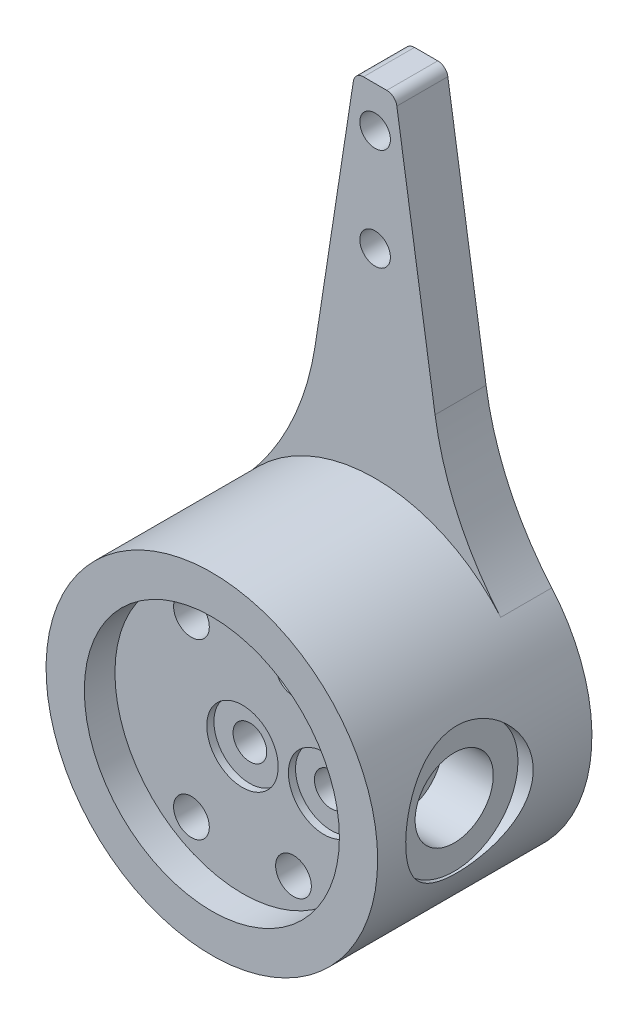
ISO-10303-21;
HEADER;
FILE_DESCRIPTION(('STEP AP214'),'2;1');
FILE_NAME('part.step','',(''),(''),'','','');
FILE_SCHEMA(('AUTOMOTIVE_DESIGN { 1 0 10303 214 1 1 1 1 }'));
ENDSEC;
DATA;
#1=APPLICATION_CONTEXT('core data for automotive mechanical design processes');
#2=APPLICATION_PROTOCOL_DEFINITION('international standard','automotive_design',2000,#1);
#3=PRODUCT_CONTEXT('',#1,'mechanical');
#4=PRODUCT('Part','Part','',(#3));
#5=PRODUCT_RELATED_PRODUCT_CATEGORY('part','',(#4));
#6=PRODUCT_DEFINITION_FORMATION('','',#4);
#7=PRODUCT_DEFINITION_CONTEXT('part definition',#1,'design');
#8=PRODUCT_DEFINITION('design','',#6,#7);
#9=PRODUCT_DEFINITION_SHAPE('','',#8);
#10=(LENGTH_UNIT() NAMED_UNIT(*) SI_UNIT(.MILLI.,.METRE.));
#11=(NAMED_UNIT(*) PLANE_ANGLE_UNIT() SI_UNIT($,.RADIAN.));
#12=(NAMED_UNIT(*) SI_UNIT($,.STERADIAN.) SOLID_ANGLE_UNIT());
#13=UNCERTAINTY_MEASURE_WITH_UNIT(LENGTH_MEASURE(1.E-05),#10,'distance_accuracy_value','');
#14=(GEOMETRIC_REPRESENTATION_CONTEXT(3) GLOBAL_UNCERTAINTY_ASSIGNED_CONTEXT((#13)) GLOBAL_UNIT_ASSIGNED_CONTEXT((#10,
#11,#12)) REPRESENTATION_CONTEXT('',''));
#15=CARTESIAN_POINT('',(0.,0.,0.));
#16=DIRECTION('',(0.,0.,1.));
#17=DIRECTION('',(1.,0.,0.));
#18=AXIS2_PLACEMENT_3D('',#15,#16,#17);
#19=CARTESIAN_POINT('',(0.0546906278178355,0.,34.6));
#20=DIRECTION('',(0.,0.,1.));
#21=DIRECTION('',(1.,0.,0.));
#22=AXIS2_PLACEMENT_3D('',#19,#20,#21);
#23=CYLINDRICAL_SURFACE('',#22,3.29999999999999);
#24=CARTESIAN_POINT('',(0.0546906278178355,0.,34.6));
#25=DIRECTION('',(0.,0.,1.));
#26=DIRECTION('',(1.,0.,0.));
#27=AXIS2_PLACEMENT_3D('',#24,#25,#26);
#28=CIRCLE('',#27,3.29999999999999);
#29=CARTESIAN_POINT('',(3.35469062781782,0.,34.6));
#30=VERTEX_POINT('',#29);
#31=EDGE_CURVE('E271',#30,#30,#28,.T.);
#32=ORIENTED_EDGE('',*,*,#31,.T.);
#33=EDGE_LOOP('',(#32));
#34=FACE_BOUND('',#33,.T.);
#35=CARTESIAN_POINT('',(0.0546906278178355,0.,17.6));
#36=DIRECTION('',(0.,0.,1.));
#37=DIRECTION('',(1.,0.,0.));
#38=AXIS2_PLACEMENT_3D('',#35,#36,#37);
#39=CIRCLE('',#38,3.3);
#40=CARTESIAN_POINT('',(3.35469062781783,0.,17.6));
#41=VERTEX_POINT('',#40);
#42=EDGE_CURVE('E274',#41,#41,#39,.T.);
#43=ORIENTED_EDGE('',*,*,#42,.F.);
#44=EDGE_LOOP('',(#43));
#45=FACE_BOUND('',#44,.T.);
#46=DIRECTION('',(0.,0.,1.));
#47=VECTOR('',#46,1.);
#48=CARTESIAN_POINT('',(-1.00000000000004,-3.1269198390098,34.6));
#49=LINE('',#48,#47);
#50=CARTESIAN_POINT('',(-1.00000000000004,-3.1269198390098,25.5723779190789));
#51=VERTEX_POINT('',#50);
#52=CARTESIAN_POINT('',(-1.00000000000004,-3.1269198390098,22.4276220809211));
#53=VERTEX_POINT('',#52);
#54=EDGE_CURVE('E11',#51,#53,#49,.F.);
#55=ORIENTED_EDGE('',*,*,#54,.F.);
#56=CARTESIAN_POINT('',(-1.00000000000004,-3.1269198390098,25.5723779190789));
#57=CARTESIAN_POINT('',(-1.05583839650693,-3.10807306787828,25.6098798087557));
#58=CARTESIAN_POINT('',(-1.11064659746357,-3.08793296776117,25.6482304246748));
#59=CARTESIAN_POINT('',(-1.21840131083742,-3.04509753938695,25.7260749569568));
#60=CARTESIAN_POINT('',(-1.27134829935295,-3.02240287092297,25.7655685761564));
#61=CARTESIAN_POINT('',(-1.37565360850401,-2.97445896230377,25.8451997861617));
#62=CARTESIAN_POINT('',(-1.42701049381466,-2.94920749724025,25.8853379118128));
#63=CARTESIAN_POINT('',(-1.52819650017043,-2.89615809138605,25.9658568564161));
#64=CARTESIAN_POINT('',(-1.57802550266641,-2.8683599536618,26.0062376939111));
#65=CARTESIAN_POINT('',(-1.72633982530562,-2.7805106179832,26.1281096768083));
#66=CARTESIAN_POINT('',(-1.82259345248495,-2.71649126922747,26.2095062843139));
#67=CARTESIAN_POINT('',(-2.00902638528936,-2.57770464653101,26.3699576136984));
#68=CARTESIAN_POINT('',(-2.09920886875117,-2.50294306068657,26.4490135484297));
#69=CARTESIAN_POINT('',(-2.24790286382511,-2.36540745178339,26.580916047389));
#70=CARTESIAN_POINT('',(-2.30806223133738,-2.3053717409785,26.634760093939));
#71=CARTESIAN_POINT('',(-2.42458758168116,-2.1795736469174,26.7397412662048));
#72=CARTESIAN_POINT('',(-2.48095379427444,-2.11381161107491,26.790878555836));
#73=CARTESIAN_POINT('',(-2.6432518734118,-1.90825859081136,26.9388623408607));
#74=CARTESIAN_POINT('',(-2.74297341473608,-1.75966474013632,27.0308092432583));
#75=CARTESIAN_POINT('',(-2.90077845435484,-1.47499712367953,27.1771276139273));
#76=CARTESIAN_POINT('',(-2.96319902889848,-1.34327936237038,27.2353196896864));
#77=CARTESIAN_POINT('',(-3.07140297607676,-1.06741965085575,27.3364784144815));
#78=CARTESIAN_POINT('',(-3.11718944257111,-0.923280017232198,27.379447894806));
#79=CARTESIAN_POINT('',(-3.17116794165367,-0.699865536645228,27.4301789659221));
#80=CARTESIAN_POINT('',(-3.18674661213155,-0.623838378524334,27.4448362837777));
#81=CARTESIAN_POINT('',(-3.21257949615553,-0.470112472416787,27.4691547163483));
#82=CARTESIAN_POINT('',(-3.22283635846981,-0.392414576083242,27.4788183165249));
#83=CARTESIAN_POINT('',(-3.23779359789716,-0.236038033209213,27.4929137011));
#84=CARTESIAN_POINT('',(-3.2424958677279,-0.157359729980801,27.4973472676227));
#85=CARTESIAN_POINT('',(-3.24625205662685,0.000225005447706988,27.5008888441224));
#86=CARTESIAN_POINT('',(-3.24530660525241,0.0791314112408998,27.4999974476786));
#87=CARTESIAN_POINT('',(-3.23493676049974,0.29539015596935,27.4902206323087));
#88=CARTESIAN_POINT('',(-3.21969683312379,0.432292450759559,27.4758522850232));
#89=CARTESIAN_POINT('',(-3.17295747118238,0.700638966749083,27.4318583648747));
#90=CARTESIAN_POINT('',(-3.14145540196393,0.832082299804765,27.402230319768));
#91=CARTESIAN_POINT('',(-3.06330847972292,1.08926569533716,27.3289232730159));
#92=CARTESIAN_POINT('',(-3.01637481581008,1.21484025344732,27.2849764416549));
#93=CARTESIAN_POINT('',(-2.9098927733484,1.45554231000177,27.1856538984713));
#94=CARTESIAN_POINT('',(-2.85034228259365,1.57066805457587,27.1302762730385));
#95=CARTESIAN_POINT('',(-2.68778518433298,1.84544330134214,26.979893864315));
#96=CARTESIAN_POINT('',(-2.57807298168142,1.99799139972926,26.8790516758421));
#97=CARTESIAN_POINT('',(-2.40005650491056,2.20741770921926,26.7175661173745));
#98=CARTESIAN_POINT('',(-2.33829788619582,2.27414200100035,26.6618754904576));
#99=CARTESIAN_POINT('',(-2.21075895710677,2.40121407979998,26.5478313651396));
#100=CARTESIAN_POINT('',(-2.14497871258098,2.46156197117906,26.4894779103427));
#101=CARTESIAN_POINT('',(-1.99709225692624,2.58674810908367,26.3597288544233));
#102=CARTESIAN_POINT('',(-1.91424125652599,2.65029856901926,26.2879433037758));
#103=CARTESIAN_POINT('',(-1.74375108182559,2.76882462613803,26.142982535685));
#104=CARTESIAN_POINT('',(-1.65611100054,2.8237985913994,26.0698070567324));
#105=CARTESIAN_POINT('',(-1.47690312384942,2.92484238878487,25.9243296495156));
#106=CARTESIAN_POINT('',(-1.38538484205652,2.97099777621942,25.8520264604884));
#107=CARTESIAN_POINT('',(-1.24412541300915,3.03409505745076,25.7452730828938));
#108=CARTESIAN_POINT('',(-1.1963785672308,3.05410372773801,25.7099744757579));
#109=CARTESIAN_POINT('',(-1.09936843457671,3.09206239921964,25.6403452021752));
#110=CARTESIAN_POINT('',(-1.0501048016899,3.11001192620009,25.6060147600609));
#111=CARTESIAN_POINT('',(-1.00000000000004,3.1269198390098,25.5723779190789));
#112=B_SPLINE_CURVE_WITH_KNOTS('',3,(#56,#57,#58,#59,#60,#61,#62,#63,#64,#65,#66,#67,#68,#69,
#70,#71,#72,#73,#74,#75,#76,#77,#78,#79,#80,#81,#82,#83,#84,#85,#86,#87,#88,#89,#90,#91,#92,#93,
#94,#95,#96,#97,#98,#99,#100,#101,#102,#103,#104,#105,#106,#107,#108,#109,#110,#111),
.UNSPECIFIED.,.F.,.F.,(4,2,2,2,2,2,2,2,2,2,2,2,2,2,2,2,2,2,2,2,2,2,2,2,2,2,2,4),(0.,
0.209508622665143,0.418963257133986,0.62860175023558,0.838256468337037,1.26183430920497,
1.68518868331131,1.98675735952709,2.28830775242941,2.88856694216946,3.35769884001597,
3.82674343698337,4.06338250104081,4.29990367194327,4.53634422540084,4.77275842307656,
5.18608638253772,5.59948132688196,6.02110118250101,6.44279167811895,7.07875717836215,
7.39840828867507,7.71805416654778,8.09777656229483,8.47757112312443,8.85346968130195,
9.04139403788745,9.22936158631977),.UNSPECIFIED.);
#113=CARTESIAN_POINT('',(-1.00000000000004,3.1269198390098,25.5723779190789));
#114=VERTEX_POINT('',#113);
#115=EDGE_CURVE('E128',#51,#114,#112,.T.);
#116=ORIENTED_EDGE('',*,*,#115,.T.);
#117=DIRECTION('',(0.,0.,1.));
#118=VECTOR('',#117,1.);
#119=CARTESIAN_POINT('',(-1.00000000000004,3.1269198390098,34.6));
#120=LINE('',#119,#118);
#121=CARTESIAN_POINT('',(-1.00000000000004,3.1269198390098,22.4276220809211));
#122=VERTEX_POINT('',#121);
#123=EDGE_CURVE('E42',#122,#114,#120,.T.);
#124=ORIENTED_EDGE('',*,*,#123,.F.);
#125=CARTESIAN_POINT('',(-1.00000000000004,3.1269198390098,22.4276220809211));
#126=CARTESIAN_POINT('',(-1.05583839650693,3.10807306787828,22.3901201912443));
#127=CARTESIAN_POINT('',(-1.11064659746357,3.08793296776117,22.3517695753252));
#128=CARTESIAN_POINT('',(-1.21840131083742,3.04509753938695,22.2739250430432));
#129=CARTESIAN_POINT('',(-1.27134829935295,3.02240287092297,22.2344314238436));
#130=CARTESIAN_POINT('',(-1.37565360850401,2.97445896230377,22.1548002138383));
#131=CARTESIAN_POINT('',(-1.42701049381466,2.94920749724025,22.1146620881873));
#132=CARTESIAN_POINT('',(-1.52819650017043,2.89615809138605,22.034143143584));
#133=CARTESIAN_POINT('',(-1.57802550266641,2.8683599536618,21.9937623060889));
#134=CARTESIAN_POINT('',(-1.72633982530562,2.7805106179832,21.8718903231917));
#135=CARTESIAN_POINT('',(-1.82259345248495,2.71649126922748,21.7904937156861));
#136=CARTESIAN_POINT('',(-2.00902638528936,2.57770464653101,21.6300423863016));
#137=CARTESIAN_POINT('',(-2.09920886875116,2.50294306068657,21.5509864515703));
#138=CARTESIAN_POINT('',(-2.2479028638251,2.36540745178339,21.419083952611));
#139=CARTESIAN_POINT('',(-2.30806223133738,2.3053717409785,21.365239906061));
#140=CARTESIAN_POINT('',(-2.42458758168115,2.1795736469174,21.2602587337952));
#141=CARTESIAN_POINT('',(-2.48095379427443,2.11381161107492,21.209121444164));
#142=CARTESIAN_POINT('',(-2.6432518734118,1.90825859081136,21.0611376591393));
#143=CARTESIAN_POINT('',(-2.74297341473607,1.75966474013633,20.9691907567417));
#144=CARTESIAN_POINT('',(-2.90077845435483,1.47499712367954,20.8228723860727));
#145=CARTESIAN_POINT('',(-2.96319902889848,1.34327936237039,20.7646803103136));
#146=CARTESIAN_POINT('',(-3.07140297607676,1.06741965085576,20.6635215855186));
#147=CARTESIAN_POINT('',(-3.11718944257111,0.923280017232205,20.620552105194));
#148=CARTESIAN_POINT('',(-3.17116794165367,0.699865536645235,20.5698210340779));
#149=CARTESIAN_POINT('',(-3.18674661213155,0.62383837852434,20.5551637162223));
#150=CARTESIAN_POINT('',(-3.21257949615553,0.470112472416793,20.5308452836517));
#151=CARTESIAN_POINT('',(-3.22283635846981,0.392414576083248,20.5211816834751));
#152=CARTESIAN_POINT('',(-3.23779359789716,0.23603803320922,20.5070862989));
#153=CARTESIAN_POINT('',(-3.2424958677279,0.157359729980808,20.5026527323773));
#154=CARTESIAN_POINT('',(-3.24625205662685,-0.000225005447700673,20.4991111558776));
#155=CARTESIAN_POINT('',(-3.24530660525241,-0.0791314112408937,20.5000025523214));
#156=CARTESIAN_POINT('',(-3.23493676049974,-0.295390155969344,20.5097793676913));
#157=CARTESIAN_POINT('',(-3.21969683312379,-0.432292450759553,20.5241477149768));
#158=CARTESIAN_POINT('',(-3.17295747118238,-0.700638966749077,20.5681416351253));
#159=CARTESIAN_POINT('',(-3.14145540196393,-0.83208229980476,20.597769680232));
#160=CARTESIAN_POINT('',(-3.06330847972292,-1.08926569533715,20.6710767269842));
#161=CARTESIAN_POINT('',(-3.01637481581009,-1.21484025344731,20.7150235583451));
#162=CARTESIAN_POINT('',(-2.90989277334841,-1.45554231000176,20.8143461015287));
#163=CARTESIAN_POINT('',(-2.85034228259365,-1.57066805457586,20.8697237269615));
#164=CARTESIAN_POINT('',(-2.68778518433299,-1.84544330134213,21.020106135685));
#165=CARTESIAN_POINT('',(-2.57807298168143,-1.99799139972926,21.1209483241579));
#166=CARTESIAN_POINT('',(-2.40005650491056,-2.20741770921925,21.2824338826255));
#167=CARTESIAN_POINT('',(-2.33829788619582,-2.27414200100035,21.3381245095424));
#168=CARTESIAN_POINT('',(-2.21075895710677,-2.40121407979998,21.4521686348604));
#169=CARTESIAN_POINT('',(-2.14497871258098,-2.46156197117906,21.5105220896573));
#170=CARTESIAN_POINT('',(-1.99709225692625,-2.58674810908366,21.6402711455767));
#171=CARTESIAN_POINT('',(-1.914241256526,-2.65029856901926,21.7120566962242));
#172=CARTESIAN_POINT('',(-1.7437510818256,-2.76882462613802,21.857017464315));
#173=CARTESIAN_POINT('',(-1.65611100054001,-2.8237985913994,21.9301929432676));
#174=CARTESIAN_POINT('',(-1.47690312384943,-2.92484238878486,22.0756703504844));
#175=CARTESIAN_POINT('',(-1.38538484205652,-2.97099777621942,22.1479735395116));
#176=CARTESIAN_POINT('',(-1.24412541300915,-3.03409505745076,22.2547269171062));
#177=CARTESIAN_POINT('',(-1.1963785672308,-3.05410372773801,22.2900255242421));
#178=CARTESIAN_POINT('',(-1.09936843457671,-3.09206239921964,22.3596547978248));
#179=CARTESIAN_POINT('',(-1.05010480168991,-3.11001192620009,22.3939852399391));
#180=CARTESIAN_POINT('',(-1.00000000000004,-3.1269198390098,22.4276220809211));
#181=B_SPLINE_CURVE_WITH_KNOTS('',3,(#125,#126,#127,#128,#129,#130,#131,#132,#133,#134,#135,
#136,#137,#138,#139,#140,#141,#142,#143,#144,#145,#146,#147,#148,#149,#150,#151,#152,#153,#154,
#155,#156,#157,#158,#159,#160,#161,#162,#163,#164,#165,#166,#167,#168,#169,#170,#171,#172,#173,
#174,#175,#176,#177,#178,#179,#180),.UNSPECIFIED.,.F.,.F.,(4,2,2,2,2,2,2,2,2,2,2,2,2,2,2,2,2,2,
2,2,2,2,2,2,2,2,2,4),(0.,0.209508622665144,0.418963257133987,0.628601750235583,
0.838256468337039,1.26183430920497,1.68518868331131,1.98675735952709,2.2883077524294,
2.88856694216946,3.35769884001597,3.82674343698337,4.06338250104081,4.29990367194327,
4.53634422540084,4.77275842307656,5.18608638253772,5.59948132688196,6.02110118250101,
6.44279167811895,7.07875717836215,7.39840828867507,7.71805416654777,8.09777656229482,
8.47757112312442,8.85346968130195,9.04139403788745,9.22936158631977),.UNSPECIFIED.);
#182=EDGE_CURVE('E137',#122,#53,#181,.T.);
#183=ORIENTED_EDGE('',*,*,#182,.T.);
#184=EDGE_LOOP('',(#55,#116,#124,#183));
#185=FACE_BOUND('',#184,.T.);
#186=ADVANCED_FACE('F34',(#34,#45,#185),#23,.F.);
#187=CARTESIAN_POINT('',(0.,0.,10.));
#188=DIRECTION('',(0.,0.,-1.));
#189=DIRECTION('',(-1.,0.,0.));
#190=AXIS2_PLACEMENT_3D('',#187,#188,#189);
#191=CYLINDRICAL_SURFACE('',#190,32.5);
#192=CARTESIAN_POINT('',(30.,12.5,24.));
#193=CARTESIAN_POINT('',(29.9999980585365,12.5000020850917,23.663210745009));
#194=CARTESIAN_POINT('',(30.0056864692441,12.4863779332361,23.3264487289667));
#195=CARTESIAN_POINT('',(30.0282410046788,12.4320399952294,22.655520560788));
#196=CARTESIAN_POINT('',(30.0451059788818,12.3913289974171,22.3213541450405));
#197=CARTESIAN_POINT('',(30.0894487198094,12.2832597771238,21.6581149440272));
#198=CARTESIAN_POINT('',(30.1169256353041,12.2159036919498,21.3290417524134));
#199=CARTESIAN_POINT('',(30.1816006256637,12.0552258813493,20.6782736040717));
#200=CARTESIAN_POINT('',(30.2187990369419,11.9619032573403,20.3565789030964));
#201=CARTESIAN_POINT('',(30.3016417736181,11.7504615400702,19.7235879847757));
#202=CARTESIAN_POINT('',(30.3472623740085,11.6324119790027,19.412265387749));
#203=CARTESIAN_POINT('',(30.445688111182,11.3723086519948,18.8008643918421));
#204=CARTESIAN_POINT('',(30.498495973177,11.230245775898,18.5007903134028));
#205=CARTESIAN_POINT('',(30.6097910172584,10.923247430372,17.9137559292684));
#206=CARTESIAN_POINT('',(30.668277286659,10.758315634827,17.6267935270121));
#207=CARTESIAN_POINT('',(30.7894013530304,10.4066019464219,17.0673331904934));
#208=CARTESIAN_POINT('',(30.8520410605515,10.2198099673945,16.7948420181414));
#209=CARTESIAN_POINT('',(30.9828934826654,9.81618180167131,16.2532590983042));
#210=CARTESIAN_POINT('',(31.051229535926,9.59833842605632,15.9849473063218));
#211=CARTESIAN_POINT('',(31.1887998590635,9.14142520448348,15.4675072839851));
#212=CARTESIAN_POINT('',(31.2580337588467,8.9023638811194,15.2183714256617));
#213=CARTESIAN_POINT('',(31.3956497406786,8.40416505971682,14.7404518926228));
#214=CARTESIAN_POINT('',(31.4640312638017,8.14501511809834,14.5116810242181));
#215=CARTESIAN_POINT('',(31.5980957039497,7.60833824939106,14.076161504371));
#216=CARTESIAN_POINT('',(31.6637796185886,7.33081821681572,13.8694046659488));
#217=CARTESIAN_POINT('',(31.7930825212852,6.74848428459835,13.4721007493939));
#218=CARTESIAN_POINT('',(31.8565396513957,6.4430449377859,13.2824161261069));
#219=CARTESIAN_POINT('',(31.9769687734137,5.81596000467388,12.9295872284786));
#220=CARTESIAN_POINT('',(32.0339405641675,5.4943139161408,12.7664437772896));
#221=CARTESIAN_POINT('',(32.139746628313,4.83708832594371,12.4681849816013));
#222=CARTESIAN_POINT('',(32.1885832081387,4.50151280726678,12.3330616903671));
#223=CARTESIAN_POINT('',(32.2766988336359,3.81878834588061,12.0921087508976));
#224=CARTESIAN_POINT('',(32.3159784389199,3.47164008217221,11.9862773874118));
#225=CARTESIAN_POINT('',(32.3822667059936,2.78434330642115,11.8091168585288));
#226=CARTESIAN_POINT('',(32.4097492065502,2.44458608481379,11.7364460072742));
#227=CARTESIAN_POINT('',(32.4541502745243,1.75952429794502,11.6195799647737));
#228=CARTESIAN_POINT('',(32.4710691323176,1.4142198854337,11.5753839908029));
#229=CARTESIAN_POINT('',(32.4938553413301,0.720865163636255,11.515954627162));
#230=CARTESIAN_POINT('',(32.4997259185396,0.372815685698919,11.5007127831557));
#231=CARTESIAN_POINT('',(32.5002552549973,-0.323344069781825,11.4993361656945));
#232=CARTESIAN_POINT('',(32.4949143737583,-0.671454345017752,11.5132004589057));
#233=CARTESIAN_POINT('',(32.4737446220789,-1.34687934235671,11.5683996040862));
#234=CARTESIAN_POINT('',(32.458476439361,-1.67433292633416,11.6082662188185));
#235=CARTESIAN_POINT('',(32.4184027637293,-2.3244850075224,11.7136168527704));
#236=CARTESIAN_POINT('',(32.3935976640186,-2.64718370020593,11.7790998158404));
#237=CARTESIAN_POINT('',(32.3350776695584,-3.28565622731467,11.9350728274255));
#238=CARTESIAN_POINT('',(32.3013624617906,-3.60142981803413,12.0255637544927));
#239=CARTESIAN_POINT('',(32.2258597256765,-4.22401564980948,12.230754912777));
#240=CARTESIAN_POINT('',(32.1840719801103,-4.53082764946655,12.3454557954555));
#241=CARTESIAN_POINT('',(32.0927783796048,-5.13801549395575,12.5999677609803));
#242=CARTESIAN_POINT('',(32.0431690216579,-5.43823261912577,12.7401200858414));
#243=CARTESIAN_POINT('',(31.9378773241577,-6.02587260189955,13.0433479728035));
#244=CARTESIAN_POINT('',(31.8821927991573,-6.31329080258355,13.2064317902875));
#245=CARTESIAN_POINT('',(31.7660926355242,-6.87366340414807,13.5543535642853));
#246=CARTESIAN_POINT('',(31.7056766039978,-7.14661660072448,13.7391933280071));
#247=CARTESIAN_POINT('',(31.5815412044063,-7.67661051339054,14.1294396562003));
#248=CARTESIAN_POINT('',(31.5178216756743,-7.93365045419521,14.3348472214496));
#249=CARTESIAN_POINT('',(31.3846128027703,-8.44572633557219,14.7782149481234));
#250=CARTESIAN_POINT('',(31.3150091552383,-8.69967440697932,15.0173985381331));
#251=CARTESIAN_POINT('',(31.1756148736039,-9.18668655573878,15.5161166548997));
#252=CARTESIAN_POINT('',(31.1058242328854,-9.41974988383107,15.7756519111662));
#253=CARTESIAN_POINT('',(30.9679315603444,-9.86363264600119,16.3136234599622));
#254=CARTESIAN_POINT('',(30.8998299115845,-10.0744470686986,16.5920639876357));
#255=CARTESIAN_POINT('',(30.7672292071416,-10.4724217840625,17.1662303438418));
#256=CARTESIAN_POINT('',(30.7027305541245,-10.6595794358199,17.4619580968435));
#257=CARTESIAN_POINT('',(30.5777015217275,-11.0131838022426,18.0764445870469));
#258=CARTESIAN_POINT('',(30.5173083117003,-11.1790055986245,18.3955915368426));
#259=CARTESIAN_POINT('',(30.4042629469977,-11.4829041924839,19.0479959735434));
#260=CARTESIAN_POINT('',(30.3516074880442,-11.6209928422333,19.3812473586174));
#261=CARTESIAN_POINT('',(30.2558128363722,-11.8681663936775,20.0595822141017));
#262=CARTESIAN_POINT('',(30.2126711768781,-11.9772588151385,20.4046625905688));
#263=CARTESIAN_POINT('',(30.1374407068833,-12.1653175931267,21.1041122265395));
#264=CARTESIAN_POINT('',(30.105351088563,-12.2442861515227,21.4584808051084));
#265=CARTESIAN_POINT('',(30.0549201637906,-12.3675357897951,22.1530507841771));
#266=CARTESIAN_POINT('',(30.0358946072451,-12.4135498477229,22.4928956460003));
#267=CARTESIAN_POINT('',(30.0093851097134,-12.4775004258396,23.1756635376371));
#268=CARTESIAN_POINT('',(30.0019007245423,-12.495438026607,23.5185864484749));
#269=CARTESIAN_POINT('',(29.9987372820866,-12.5030307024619,24.2047165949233));
#270=CARTESIAN_POINT('',(30.003055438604,-12.4926924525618,24.5479237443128));
#271=CARTESIAN_POINT('',(30.0233391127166,-12.4438661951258,25.2319759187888));
#272=CARTESIAN_POINT('',(30.0393043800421,-12.4053787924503,25.572820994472));
#273=CARTESIAN_POINT('',(30.0812243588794,-12.3033653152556,26.2322109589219));
#274=CARTESIAN_POINT('',(30.1066273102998,-12.241218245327,26.5510057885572));
#275=CARTESIAN_POINT('',(30.1666411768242,-12.092567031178,27.1819597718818));
#276=CARTESIAN_POINT('',(30.2012517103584,-12.0060638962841,27.4941191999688));
#277=CARTESIAN_POINT('',(30.2786657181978,-11.809468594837,28.109854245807));
#278=CARTESIAN_POINT('',(30.3214690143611,-11.699376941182,28.4134300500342));
#279=CARTESIAN_POINT('',(30.4140872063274,-11.4564476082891,29.0103584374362));
#280=CARTESIAN_POINT('',(30.4639048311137,-11.3236010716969,29.3037069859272));
#281=CARTESIAN_POINT('',(30.5712279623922,-11.0306512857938,29.889485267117));
#282=CARTESIAN_POINT('',(30.6289547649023,-10.8696992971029,30.181449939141));
#283=CARTESIAN_POINT('',(30.7489685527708,-10.5254059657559,30.751046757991));
#284=CARTESIAN_POINT('',(30.8112575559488,-10.34205469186,31.0286724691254));
#285=CARTESIAN_POINT('',(30.9387529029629,-9.95415698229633,31.5680323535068));
#286=CARTESIAN_POINT('',(31.003959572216,-9.74960817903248,31.8297647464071));
#287=CARTESIAN_POINT('',(31.1356446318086,-9.32051477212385,32.3359523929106));
#288=CARTESIAN_POINT('',(31.2021230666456,-9.09596946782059,32.5804070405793));
#289=CARTESIAN_POINT('',(31.3392098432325,-8.61227565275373,33.066648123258));
#290=CARTESIAN_POINT('',(31.40979363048,-8.35181413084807,33.3071374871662));
#291=CARTESIAN_POINT('',(31.548596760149,-7.81113978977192,33.7653274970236));
#292=CARTESIAN_POINT('',(31.6168169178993,-7.53093388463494,33.9830360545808));
#293=CARTESIAN_POINT('',(31.7490763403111,-6.95228300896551,34.3943148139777));
#294=CARTESIAN_POINT('',(31.813114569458,-6.65383355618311,34.587879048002));
#295=CARTESIAN_POINT('',(31.9352286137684,-6.04060386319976,34.9493273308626));
#296=CARTESIAN_POINT('',(31.9933045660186,-5.72582399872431,35.1172119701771));
#297=CARTESIAN_POINT('',(32.1017460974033,-5.08271341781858,35.4255367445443));
#298=CARTESIAN_POINT('',(32.1521289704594,-4.75441526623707,35.5660386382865));
#299=CARTESIAN_POINT('',(32.2439055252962,-4.08587552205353,35.8187696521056));
#300=CARTESIAN_POINT('',(32.2852991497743,-3.74563385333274,35.9309985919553));
#301=CARTESIAN_POINT('',(32.3578697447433,-3.05588917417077,36.1260021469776));
#302=CARTESIAN_POINT('',(32.3890509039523,-2.70639002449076,36.2087888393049));
#303=CARTESIAN_POINT('',(32.4402832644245,-2.00077805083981,36.3440637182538));
#304=CARTESIAN_POINT('',(32.4603351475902,-1.64466563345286,36.3965537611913));
#305=CARTESIAN_POINT('',(32.4878358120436,-0.950630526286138,36.4683797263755));
#306=CARTESIAN_POINT('',(32.4959787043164,-0.612923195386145,36.489542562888));
#307=CARTESIAN_POINT('',(32.5016964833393,0.0631776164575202,36.5044123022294));
#308=CARTESIAN_POINT('',(32.4992718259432,0.401571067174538,36.4981203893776));
#309=CARTESIAN_POINT('',(32.4839217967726,1.07645010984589,36.4581504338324));
#310=CARTESIAN_POINT('',(32.4709977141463,1.41293593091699,36.4244757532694));
#311=CARTESIAN_POINT('',(32.4350007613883,2.08153998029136,36.330092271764));
#312=CARTESIAN_POINT('',(32.4119279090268,2.41365821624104,36.2693835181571));
#313=CARTESIAN_POINT('',(32.3569979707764,3.06231815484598,36.1235204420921));
#314=CARTESIAN_POINT('',(32.3253927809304,3.37903878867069,36.0390646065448));
#315=CARTESIAN_POINT('',(32.2539421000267,4.00401656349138,35.8458782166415));
#316=CARTESIAN_POINT('',(32.214096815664,4.31227391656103,35.7371482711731));
#317=CARTESIAN_POINT('',(32.1271343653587,4.9184340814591,35.4963196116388));
#318=CARTESIAN_POINT('',(32.0800174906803,5.21633730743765,35.3642218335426));
#319=CARTESIAN_POINT('',(31.9796096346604,5.80020355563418,35.0776102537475));
#320=CARTESIAN_POINT('',(31.9263163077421,6.08616198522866,34.9230879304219));
#321=CARTESIAN_POINT('',(31.8124294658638,6.65638227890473,34.585695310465));
#322=CARTESIAN_POINT('',(31.7516216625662,6.94005278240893,34.4018977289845));
#323=CARTESIAN_POINT('',(31.6261440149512,7.49112242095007,34.0123419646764));
#324=CARTESIAN_POINT('',(31.561472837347,7.75851587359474,33.8065761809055));
#325=CARTESIAN_POINT('',(31.4298719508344,8.27552546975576,33.3743914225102));
#326=CARTESIAN_POINT('',(31.3629419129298,8.52513900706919,33.1479694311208));
#327=CARTESIAN_POINT('',(31.2284865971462,9.00520831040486,32.6758046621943));
#328=CARTESIAN_POINT('',(31.1609612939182,9.23566325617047,32.4300610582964));
#329=CARTESIAN_POINT('',(31.0232289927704,9.68857115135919,31.9062087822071));
#330=CARTESIAN_POINT('',(30.9530857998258,9.90983794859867,31.6270561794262));
#331=CARTESIAN_POINT('',(30.8160764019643,10.3280127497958,31.0504572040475));
#332=CARTESIAN_POINT('',(30.7492090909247,10.5249290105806,30.753017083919));
#333=CARTESIAN_POINT('',(30.6206898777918,10.8931824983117,30.1413421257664));
#334=CARTESIAN_POINT('',(30.5590413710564,11.0645031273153,29.8270965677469));
#335=CARTESIAN_POINT('',(30.4429814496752,11.3799441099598,29.1841153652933));
#336=CARTESIAN_POINT('',(30.3885670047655,11.5240758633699,28.855385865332));
#337=CARTESIAN_POINT('',(30.2854301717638,11.7925739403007,28.1631734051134));
#338=CARTESIAN_POINT('',(30.2373291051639,11.9149819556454,27.7988345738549));
#339=CARTESIAN_POINT('',(30.1533245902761,12.1260027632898,27.0590844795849));
#340=CARTESIAN_POINT('',(30.1174219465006,12.2146133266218,26.6836724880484));
#341=CARTESIAN_POINT('',(30.0593524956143,12.3568298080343,25.9254686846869));
#342=CARTESIAN_POINT('',(30.037176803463,12.410458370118,25.5426818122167));
#343=CARTESIAN_POINT('',(30.0075027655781,12.4820396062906,24.773250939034));
#344=CARTESIAN_POINT('',(30.000002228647,12.499997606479,24.3866075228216));
#345=CARTESIAN_POINT('',(30.,12.5,24.));
#346=B_SPLINE_CURVE_WITH_KNOTS('',3,(#192,#193,#194,#195,#196,#197,#198,#199,#200,#201,#202,
#203,#204,#205,#206,#207,#208,#209,#210,#211,#212,#213,#214,#215,#216,#217,#218,#219,#220,#221,
#222,#223,#224,#225,#226,#227,#228,#229,#230,#231,#232,#233,#234,#235,#236,#237,#238,#239,#240,
#241,#242,#243,#244,#245,#246,#247,#248,#249,#250,#251,#252,#253,#254,#255,#256,#257,#258,#259,
#260,#261,#262,#263,#264,#265,#266,#267,#268,#269,#270,#271,#272,#273,#274,#275,#276,#277,#278,
#279,#280,#281,#282,#283,#284,#285,#286,#287,#288,#289,#290,#291,#292,#293,#294,#295,#296,#297,
#298,#299,#300,#301,#302,#303,#304,#305,#306,#307,#308,#309,#310,#311,#312,#313,#314,#315,#316,
#317,#318,#319,#320,#321,#322,#323,#324,#325,#326,#327,#328,#329,#330,#331,#332,#333,#334,#335,
#336,#337,#338,#339,#340,#341,#342,#343,#344,#345),.UNSPECIFIED.,.T.,.F.,(4,2,2,2,2,2,2,2,2,2,2,
2,2,2,2,2,2,2,2,2,2,2,2,2,2,2,2,2,2,2,2,2,2,2,2,2,2,2,2,2,2,2,2,2,2,2,2,2,2,2,2,2,2,2,2,2,2,2,2,
2,2,2,2,2,2,2,2,2,2,2,2,2,2,2,2,2,4),(0.,1.00999932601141,2.01989469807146,3.02970907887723,
4.03955840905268,5.04660527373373,6.0540350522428,7.06130317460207,8.06903789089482,
9.12476630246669,10.1800725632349,11.2360378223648,12.291608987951,13.3855514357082,
14.4795278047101,15.5731934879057,16.666795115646,17.7110359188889,18.75524801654,
19.7991551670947,20.8430288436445,21.8325388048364,22.8220079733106,23.811511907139,
24.8010424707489,25.8049784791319,26.8092768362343,27.8136586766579,28.8180894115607,
29.8840661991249,30.9500812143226,32.016335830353,33.0827093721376,34.1753929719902,
35.2676085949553,36.3595406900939,37.4513929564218,38.4804834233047,39.5095342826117,
40.5383422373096,41.5671280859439,42.5433774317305,43.5195863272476,44.4957739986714,
45.4723425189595,46.4862952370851,47.5006991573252,48.5152165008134,49.5297694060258,
50.6128947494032,51.6956426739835,52.7786576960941,53.8616478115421,54.9421663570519,
56.0226917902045,57.102773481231,58.1827889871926,59.1969304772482,60.2110282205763,
61.2250014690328,62.2389729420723,63.225779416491,64.2125611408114,65.1993033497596,
66.186421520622,67.2155962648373,68.2451282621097,69.2748108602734,70.3045375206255,
71.3923944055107,72.4798814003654,73.5680705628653,74.6558024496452,75.816050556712,
76.9763751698,78.1359479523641,79.2953475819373),.UNSPECIFIED.);
#347=CARTESIAN_POINT('',(30.,12.5,24.));
#348=VERTEX_POINT('',#347);
#349=EDGE_CURVE('E206',#348,#348,#346,.T.);
#350=ORIENTED_EDGE('',*,*,#349,.T.);
#351=EDGE_LOOP('',(#350));
#352=FACE_BOUND('',#351,.T.);
#353=CARTESIAN_POINT('',(0.,0.,0.));
#354=DIRECTION('',(0.,0.,1.));
#355=DIRECTION('',(1.,0.,0.));
#356=AXIS2_PLACEMENT_3D('',#353,#354,#355);
#357=CIRCLE('',#356,32.5);
#358=CARTESIAN_POINT('',(-24.6258833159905,21.2088630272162,0.));
#359=VERTEX_POINT('',#358);
#360=CARTESIAN_POINT('',(24.6258833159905,21.2088630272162,0.));
#361=VERTEX_POINT('',#360);
#362=EDGE_CURVE('E440',#359,#361,#357,.T.);
#363=ORIENTED_EDGE('',*,*,#362,.T.);
#364=DIRECTION('',(0.,0.,-1.));
#365=VECTOR('',#364,1.);
#366=CARTESIAN_POINT('',(24.6258833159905,21.2088630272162,10.));
#367=LINE('',#366,#365);
#368=CARTESIAN_POINT('',(24.6258833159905,21.2088630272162,10.));
#369=VERTEX_POINT('',#368);
#370=EDGE_CURVE('E356',#369,#361,#367,.T.);
#371=ORIENTED_EDGE('',*,*,#370,.F.);
#372=CARTESIAN_POINT('',(0.,0.,10.));
#373=DIRECTION('',(0.,0.,1.));
#374=DIRECTION('',(1.,0.,0.));
#375=AXIS2_PLACEMENT_3D('',#372,#373,#374);
#376=CIRCLE('',#375,32.5);
#377=CARTESIAN_POINT('',(-24.6258833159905,21.2088630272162,10.));
#378=VERTEX_POINT('',#377);
#379=EDGE_CURVE('E340',#369,#378,#376,.T.);
#380=ORIENTED_EDGE('',*,*,#379,.T.);
#381=DIRECTION('',(0.,0.,-1.));
#382=VECTOR('',#381,1.);
#383=CARTESIAN_POINT('',(-24.6258833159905,21.2088630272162,10.));
#384=LINE('',#383,#382);
#385=EDGE_CURVE('E359',#378,#359,#384,.T.);
#386=ORIENTED_EDGE('',*,*,#385,.T.);
#387=EDGE_LOOP('',(#363,#371,#380,#386));
#388=FACE_BOUND('',#387,.T.);
#389=CARTESIAN_POINT('',(0.,0.,42.));
#390=DIRECTION('',(0.,0.,1.));
#391=DIRECTION('',(1.,0.,0.));
#392=AXIS2_PLACEMENT_3D('',#389,#390,#391);
#393=CIRCLE('',#392,32.5);
#394=CARTESIAN_POINT('',(32.5,0.,42.));
#395=VERTEX_POINT('',#394);
#396=EDGE_CURVE('E336',#395,#395,#393,.T.);
#397=ORIENTED_EDGE('',*,*,#396,.F.);
#398=EDGE_LOOP('',(#397));
#399=FACE_BOUND('',#398,.T.);
#400=CARTESIAN_POINT('',(-32.5,0.,36.5));
#401=CARTESIAN_POINT('',(-32.500001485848,0.337836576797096,36.500001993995));
#402=CARTESIAN_POINT('',(-32.4947211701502,0.675646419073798,36.4862937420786));
#403=CARTESIAN_POINT('',(-32.4737482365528,1.34870111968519,36.4316118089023));
#404=CARTESIAN_POINT('',(-32.4580567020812,1.68394624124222,36.3906409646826));
#405=CARTESIAN_POINT('',(-32.4166882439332,2.34934871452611,36.2818646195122));
#406=CARTESIAN_POINT('',(-32.3910133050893,2.67950706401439,36.2140644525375));
#407=CARTESIAN_POINT('',(-32.3303591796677,3.33247627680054,36.0522920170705));
#408=CARTESIAN_POINT('',(-32.2953797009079,3.65528690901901,35.958318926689));
#409=CARTESIAN_POINT('',(-32.2171068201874,4.29072361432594,35.7452866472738));
#410=CARTESIAN_POINT('',(-32.1738306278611,4.60336922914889,35.6262793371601));
#411=CARTESIAN_POINT('',(-32.0800129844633,5.21720005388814,35.3640755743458));
#412=CARTESIAN_POINT('',(-32.029471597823,5.5183853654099,35.2208793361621));
#413=CARTESIAN_POINT('',(-31.9223688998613,6.10753812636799,34.9114025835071));
#414=CARTESIAN_POINT('',(-31.865807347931,6.39550504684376,34.7451211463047));
#415=CARTESIAN_POINT('',(-31.7480126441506,6.95671971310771,34.3905854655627));
#416=CARTESIAN_POINT('',(-31.6867776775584,7.22996167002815,34.2023226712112));
#417=CARTESIAN_POINT('',(-31.5586304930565,7.77065370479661,33.7972200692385));
#418=CARTESIAN_POINT('',(-31.4915895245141,8.03744733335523,33.5795445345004));
#419=CARTESIAN_POINT('',(-31.3557523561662,8.55205593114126,33.1230858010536));
#420=CARTESIAN_POINT('',(-31.2869553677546,8.79986216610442,32.8842929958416));
#421=CARTESIAN_POINT('',(-31.1493955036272,9.27504004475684,32.3870100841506));
#422=CARTESIAN_POINT('',(-31.0806326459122,9.5024051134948,32.128513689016));
#423=CARTESIAN_POINT('',(-30.9450133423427,9.93516777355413,31.5934696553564));
#424=CARTESIAN_POINT('',(-30.8781560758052,10.140574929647,31.3169299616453));
#425=CARTESIAN_POINT('',(-30.7454705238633,10.5361926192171,30.7355247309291));
#426=CARTESIAN_POINT('',(-30.6797972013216,10.7254328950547,30.429962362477));
#427=CARTESIAN_POINT('',(-30.5545195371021,11.0772837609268,29.8028437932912));
#428=CARTESIAN_POINT('',(-30.4949127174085,11.2399052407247,29.4812942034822));
#429=CARTESIAN_POINT('',(-30.3836845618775,11.537197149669,28.8242192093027));
#430=CARTESIAN_POINT('',(-30.3320623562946,11.6718706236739,28.4886953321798));
#431=CARTESIAN_POINT('',(-30.2385768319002,11.9119727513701,27.8060217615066));
#432=CARTESIAN_POINT('',(-30.1967129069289,12.0174032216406,27.4588727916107));
#433=CARTESIAN_POINT('',(-30.1258068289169,12.1940327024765,26.7706223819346));
#434=CARTESIAN_POINT('',(-30.0962937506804,12.2665005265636,26.4298950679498));
#435=CARTESIAN_POINT('',(-30.0486260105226,12.3828123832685,25.742798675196));
#436=CARTESIAN_POINT('',(-30.0304710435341,12.4266571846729,25.3964297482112));
#437=CARTESIAN_POINT('',(-30.0061760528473,12.4852075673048,24.7009482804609));
#438=CARTESIAN_POINT('',(-30.0000314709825,12.4999242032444,24.351836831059));
#439=CARTESIAN_POINT('',(-29.9999687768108,12.5000752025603,23.6536139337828));
#440=CARTESIAN_POINT('',(-30.0060501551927,12.4855107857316,23.3045024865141));
#441=CARTESIAN_POINT('',(-30.0294439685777,12.429132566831,22.6312699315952));
#442=CARTESIAN_POINT('',(-30.0460177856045,12.3891100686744,22.3069711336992));
#443=CARTESIAN_POINT('',(-30.0891616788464,12.2839560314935,21.6631642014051));
#444=CARTESIAN_POINT('',(-30.1157312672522,12.2188257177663,21.3436558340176));
#445=CARTESIAN_POINT('',(-30.1780574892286,12.064070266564,20.7115176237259));
#446=CARTESIAN_POINT('',(-30.2138151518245,11.9744423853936,20.3988885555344));
#447=CARTESIAN_POINT('',(-30.293464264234,11.7714864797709,19.7824886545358));
#448=CARTESIAN_POINT('',(-30.3373559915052,11.6581576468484,19.4787181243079));
#449=CARTESIAN_POINT('',(-30.4329532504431,11.4063068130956,18.8760489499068));
#450=CARTESIAN_POINT('',(-30.4847931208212,11.2673412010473,18.577357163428));
#451=CARTESIAN_POINT('',(-30.5942227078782,10.966727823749,17.9925870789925));
#452=CARTESIAN_POINT('',(-30.6518145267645,10.8050717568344,17.7065134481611));
#453=CARTESIAN_POINT('',(-30.7712170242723,10.4601861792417,17.1485709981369));
#454=CARTESIAN_POINT('',(-30.8330281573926,10.2769543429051,16.8767037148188));
#455=CARTESIAN_POINT('',(-30.9593035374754,9.89004205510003,16.3485794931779));
#456=CARTESIAN_POINT('',(-31.0237679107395,9.68636062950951,16.0923232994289));
#457=CARTESIAN_POINT('',(-31.1584161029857,9.24446718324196,15.5790423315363));
#458=CARTESIAN_POINT('',(-31.2286800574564,9.00482867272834,15.3232649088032));
#459=CARTESIAN_POINT('',(-31.3685101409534,8.50493372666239,14.8327383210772));
#460=CARTESIAN_POINT('',(-31.4380765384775,8.24468559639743,14.5979807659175));
#461=CARTESIAN_POINT('',(-31.5747226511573,7.70483283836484,14.1507111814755));
#462=CARTESIAN_POINT('',(-31.6418008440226,7.42521665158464,13.9382126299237));
#463=CARTESIAN_POINT('',(-31.771607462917,6.84852311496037,13.53715940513));
#464=CARTESIAN_POINT('',(-31.8343376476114,6.55145291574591,13.3485950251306));
#465=CARTESIAN_POINT('',(-31.9548233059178,5.93625996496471,12.9936797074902));
#466=CARTESIAN_POINT('',(-32.0124738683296,5.61786180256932,12.8277697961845));
#467=CARTESIAN_POINT('',(-32.119918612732,4.96685522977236,12.5235268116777));
#468=CARTESIAN_POINT('',(-32.1697126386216,4.6342465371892,12.385194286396));
#469=CARTESIAN_POINT('',(-32.2599771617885,3.95732331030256,12.1374777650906));
#470=CARTESIAN_POINT('',(-32.300451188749,3.61301326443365,12.028082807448));
#471=CARTESIAN_POINT('',(-32.370889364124,2.91521092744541,11.8393191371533));
#472=CARTESIAN_POINT('',(-32.4008541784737,2.56171921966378,11.7599485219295));
#473=CARTESIAN_POINT('',(-32.4480160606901,1.86822654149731,11.6356619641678));
#474=CARTESIAN_POINT('',(-32.4658294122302,1.52856560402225,11.5890783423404));
#475=CARTESIAN_POINT('',(-32.4907760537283,0.846177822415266,11.5239653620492));
#476=CARTESIAN_POINT('',(-32.4979097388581,0.503451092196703,11.5054349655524));
#477=CARTESIAN_POINT('',(-32.5012971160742,-0.18234638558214,11.4966272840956));
#478=CARTESIAN_POINT('',(-32.4975530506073,-0.525417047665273,11.5063441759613));
#479=CARTESIAN_POINT('',(-32.4792945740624,-1.20930851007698,11.553913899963));
#480=CARTESIAN_POINT('',(-32.4647803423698,-1.55012934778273,11.5917662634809));
#481=CARTESIAN_POINT('',(-32.4261945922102,-2.21305573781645,11.693083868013));
#482=CARTESIAN_POINT('',(-32.4025385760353,-2.53535633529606,11.7554373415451));
#483=CARTESIAN_POINT('',(-32.3462927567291,-3.1733073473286,11.9050647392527));
#484=CARTESIAN_POINT('',(-32.3137032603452,-3.48895798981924,11.9923378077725));
#485=CARTESIAN_POINT('',(-32.2403933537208,-4.11160846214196,12.1910421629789));
#486=CARTESIAN_POINT('',(-32.1996722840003,-4.41860758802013,12.3024754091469));
#487=CARTESIAN_POINT('',(-32.1110849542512,-5.02207583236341,12.5485830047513));
#488=CARTESIAN_POINT('',(-32.0632184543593,-5.31854459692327,12.6832581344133));
#489=CARTESIAN_POINT('',(-31.9599593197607,-5.90788780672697,12.9791657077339));
#490=CARTESIAN_POINT('',(-31.9043853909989,-6.20039403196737,13.1410680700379));
#491=CARTESIAN_POINT('',(-31.7882027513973,-6.7708902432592,13.4873202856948));
#492=CARTESIAN_POINT('',(-31.7275921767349,-7.04887479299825,13.6716784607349));
#493=CARTESIAN_POINT('',(-31.6028097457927,-7.58875453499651,14.0616047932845));
#494=CARTESIAN_POINT('',(-31.5386373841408,-7.85064743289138,14.2671759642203));
#495=CARTESIAN_POINT('',(-31.4082794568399,-8.35693289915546,14.6982675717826));
#496=CARTESIAN_POINT('',(-31.3420938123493,-8.60132478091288,14.9237887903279));
#497=CARTESIAN_POINT('',(-31.2052290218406,-9.08575047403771,15.4079406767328));
#498=CARTESIAN_POINT('',(-31.1345233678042,-9.32459652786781,15.6677538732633));
#499=CARTESIAN_POINT('',(-30.9946272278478,-9.77955606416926,16.2067584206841));
#500=CARTESIAN_POINT('',(-30.9254361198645,-9.99567902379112,16.4859416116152));
#501=CARTESIAN_POINT('',(-30.7904666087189,-10.4040109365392,17.0623232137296));
#502=CARTESIAN_POINT('',(-30.7246902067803,-10.5962059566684,17.3595319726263));
#503=CARTESIAN_POINT('',(-30.5985747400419,-10.9550625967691,17.9699185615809));
#504=CARTESIAN_POINT('',(-30.5382333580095,-11.1217351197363,18.2830894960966));
#505=CARTESIAN_POINT('',(-30.4244768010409,-11.4292730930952,18.9256161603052));
#506=CARTESIAN_POINT('',(-30.3711084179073,-11.5699665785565,19.2550626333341));
#507=CARTESIAN_POINT('',(-30.2735371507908,-11.822916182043,19.9260351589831));
#508=CARTESIAN_POINT('',(-30.2293343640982,-11.9351719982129,20.2675613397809));
#509=CARTESIAN_POINT('',(-30.1516749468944,-12.1300251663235,20.9599734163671));
#510=CARTESIAN_POINT('',(-30.1182123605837,-12.2126389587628,21.3108540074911));
#511=CARTESIAN_POINT('',(-30.0632388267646,-12.347347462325,22.0193422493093));
#512=CARTESIAN_POINT('',(-30.041726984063,-12.3994444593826,22.376949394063));
#513=CARTESIAN_POINT('',(-30.0124899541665,-12.4700355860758,23.0716686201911));
#514=CARTESIAN_POINT('',(-30.0039348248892,-12.4905540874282,23.4085414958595));
#515=CARTESIAN_POINT('',(-29.9982201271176,-12.5042733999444,24.0829323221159));
#516=CARTESIAN_POINT('',(-30.0010600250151,-12.4974754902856,24.4204502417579));
#517=CARTESIAN_POINT('',(-30.0180375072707,-12.4566410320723,25.0935076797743));
#518=CARTESIAN_POINT('',(-30.0321739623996,-12.4226072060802,25.4290473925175));
#519=CARTESIAN_POINT('',(-30.0712665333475,-12.3276744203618,26.0956596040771));
#520=CARTESIAN_POINT('',(-30.0962226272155,-12.2667755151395,26.4267321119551));
#521=CARTESIAN_POINT('',(-30.155111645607,-12.1212692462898,27.0708494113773));
#522=CARTESIAN_POINT('',(-30.1887097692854,-12.0375402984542,27.3841241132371));
#523=CARTESIAN_POINT('',(-30.2642553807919,-11.8463246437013,28.0024173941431));
#524=CARTESIAN_POINT('',(-30.3062058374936,-11.7388294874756,28.3074329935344));
#525=CARTESIAN_POINT('',(-30.3972549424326,-11.501003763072,28.9072374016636));
#526=CARTESIAN_POINT('',(-30.4463521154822,-11.3706779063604,29.2020283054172));
#527=CARTESIAN_POINT('',(-30.5504046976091,-11.0880766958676,29.7799725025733));
#528=CARTESIAN_POINT('',(-30.6053627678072,-10.9357913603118,30.0631204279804));
#529=CARTESIAN_POINT('',(-30.7228217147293,-10.6014757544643,30.6312259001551));
#530=CARTESIAN_POINT('',(-30.7855701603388,-10.4182790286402,30.9154461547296));
#531=CARTESIAN_POINT('',(-30.9142685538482,-10.0299458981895,31.4675332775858));
#532=CARTESIAN_POINT('',(-30.9802173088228,-9.82481763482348,31.7354061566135));
#533=CARTESIAN_POINT('',(-31.1136654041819,-9.39365602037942,32.2536610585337));
#534=CARTESIAN_POINT('',(-31.1811657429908,-9.16760890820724,32.5040313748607));
#535=CARTESIAN_POINT('',(-31.3159424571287,-8.69608238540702,32.9856379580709));
#536=CARTESIAN_POINT('',(-31.3832188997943,-8.45060949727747,33.2168805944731));
#537=CARTESIAN_POINT('',(-31.519777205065,-7.92660987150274,33.6719275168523));
#538=CARTESIAN_POINT('',(-31.5889467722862,-7.64699001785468,33.8945089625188));
#539=CARTESIAN_POINT('',(-31.7232753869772,-7.0690734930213,34.3153271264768));
#540=CARTESIAN_POINT('',(-31.7884343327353,-6.77077634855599,34.5135632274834));
#541=CARTESIAN_POINT('',(-31.9129388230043,-6.15729613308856,34.8842156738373));
#542=CARTESIAN_POINT('',(-31.9722832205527,-5.8421097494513,35.056626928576));
#543=CARTESIAN_POINT('',(-32.0834633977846,-5.19697196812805,35.3741259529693));
#544=CARTESIAN_POINT('',(-32.1352989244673,-4.86702007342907,35.5192128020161));
#545=CARTESIAN_POINT('',(-32.2330552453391,-4.17264073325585,35.7892638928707));
#546=CARTESIAN_POINT('',(-32.2783668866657,-3.80737026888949,35.9122896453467));
#547=CARTESIAN_POINT('',(-32.3572222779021,-3.06581046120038,36.1243362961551));
#548=CARTESIAN_POINT('',(-32.3907651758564,-2.68952032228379,36.2133547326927));
#549=CARTESIAN_POINT('',(-32.4449031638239,-1.9295825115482,36.3562176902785));
#550=CARTESIAN_POINT('',(-32.4655044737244,-1.54593846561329,36.4100791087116));
#551=CARTESIAN_POINT('',(-32.4930510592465,-0.77485085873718,36.4819665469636));
#552=CARTESIAN_POINT('',(-32.4999982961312,-0.387407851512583,36.4999977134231));
#553=CARTESIAN_POINT('',(-32.5,0.,36.5));
#554=B_SPLINE_CURVE_WITH_KNOTS('',3,(#400,#401,#402,#403,#404,#405,#406,#407,#408,#409,#410,
#411,#412,#413,#414,#415,#416,#417,#418,#419,#420,#421,#422,#423,#424,#425,#426,#427,#428,#429,
#430,#431,#432,#433,#434,#435,#436,#437,#438,#439,#440,#441,#442,#443,#444,#445,#446,#447,#448,
#449,#450,#451,#452,#453,#454,#455,#456,#457,#458,#459,#460,#461,#462,#463,#464,#465,#466,#467,
#468,#469,#470,#471,#472,#473,#474,#475,#476,#477,#478,#479,#480,#481,#482,#483,#484,#485,#486,
#487,#488,#489,#490,#491,#492,#493,#494,#495,#496,#497,#498,#499,#500,#501,#502,#503,#504,#505,
#506,#507,#508,#509,#510,#511,#512,#513,#514,#515,#516,#517,#518,#519,#520,#521,#522,#523,#524,
#525,#526,#527,#528,#529,#530,#531,#532,#533,#534,#535,#536,#537,#538,#539,#540,#541,#542,#543,
#544,#545,#546,#547,#548,#549,#550,#551,#552,#553),.UNSPECIFIED.,.T.,.F.,(4,2,2,2,2,2,2,2,2,2,2,
2,2,2,2,2,2,2,2,2,2,2,2,2,2,2,2,2,2,2,2,2,2,2,2,2,2,2,2,2,2,2,2,2,2,2,2,2,2,2,2,2,2,2,2,2,2,2,2,
2,2,2,2,2,2,2,2,2,2,2,2,2,2,2,2,2,4),(0.,1.01314595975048,2.02618650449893,3.03902574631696,
4.05189679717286,5.0626891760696,6.07347259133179,7.08429641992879,8.09551478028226,
9.14672589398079,10.1984177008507,11.2504465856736,12.3020153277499,13.3967609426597,
14.4910575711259,15.5852349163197,16.6793442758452,17.726762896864,18.7741533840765,
19.82114628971,20.8680955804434,21.8484829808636,22.8288225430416,23.809271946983,
24.789754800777,25.7891419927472,26.7888957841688,27.7887574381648,28.7886667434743,
29.8598534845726,30.9306107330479,32.0020126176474,33.0729785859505,34.1624833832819,
35.2520098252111,36.3411229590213,37.4301670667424,38.4587723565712,39.4873395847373,
40.5156947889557,41.5440328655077,42.5302803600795,43.5164939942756,44.5027876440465,
45.4891144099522,46.5047330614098,47.5207292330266,48.5368699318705,49.5530504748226,
50.6315897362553,51.709677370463,52.7883898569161,53.8666402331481,54.9517903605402,
56.0369520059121,57.1215108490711,58.2059884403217,59.2175271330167,60.2290184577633,
61.2404086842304,62.2517968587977,63.2287277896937,64.2060065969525,65.1830839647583,
66.1606068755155,67.1912327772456,68.2214774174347,69.252404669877,70.2829872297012,
71.3737490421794,72.4645385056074,73.5555427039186,74.6465836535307,75.809032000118,
76.9715644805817,78.1335378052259,79.2953442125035),.UNSPECIFIED.);
#555=CARTESIAN_POINT('',(-32.5,0.,36.5));
#556=VERTEX_POINT('',#555);
#557=EDGE_CURVE('E185',#556,#556,#554,.T.);
#558=ORIENTED_EDGE('',*,*,#557,.F.);
#559=EDGE_LOOP('',(#558));
#560=FACE_BOUND('',#559,.T.);
#561=ADVANCED_FACE('F193',(#352,#388,#399,#560),#191,.T.);
#562=CARTESIAN_POINT('',(16.,0.,34.6));
#563=DIRECTION('',(0.,0.,1.));
#564=DIRECTION('',(1.,0.,0.));
#565=AXIS2_PLACEMENT_3D('',#562,#563,#564);
#566=CYLINDRICAL_SURFACE('',#565,3.29999999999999);
#567=CARTESIAN_POINT('',(16.,0.,34.6));
#568=DIRECTION('',(0.,0.,1.));
#569=DIRECTION('',(1.,0.,0.));
#570=AXIS2_PLACEMENT_3D('',#567,#568,#569);
#571=CIRCLE('',#570,3.29999999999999);
#572=CARTESIAN_POINT('',(19.3,0.,34.6));
#573=VERTEX_POINT('',#572);
#574=EDGE_CURVE('E796',#573,#573,#571,.T.);
#575=ORIENTED_EDGE('',*,*,#574,.T.);
#576=EDGE_LOOP('',(#575));
#577=FACE_BOUND('',#576,.T.);
#578=CARTESIAN_POINT('',(16.,0.,17.6));
#579=DIRECTION('',(0.,0.,1.));
#580=DIRECTION('',(1.,0.,0.));
#581=AXIS2_PLACEMENT_3D('',#578,#579,#580);
#582=CIRCLE('',#581,3.3);
#583=CARTESIAN_POINT('',(19.3,0.,17.6));
#584=VERTEX_POINT('',#583);
#585=EDGE_CURVE('E281',#584,#584,#582,.T.);
#586=ORIENTED_EDGE('',*,*,#585,.F.);
#587=EDGE_LOOP('',(#586));
#588=FACE_BOUND('',#587,.T.);
#589=DIRECTION('',(0.,0.,1.));
#590=VECTOR('',#589,1.);
#591=CARTESIAN_POINT('',(16.5,3.26190128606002,34.6));
#592=LINE('',#591,#590);
#593=CARTESIAN_POINT('',(16.5,3.26190128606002,25.2688577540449));
#594=VERTEX_POINT('',#593);
#595=CARTESIAN_POINT('',(16.5,3.26190128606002,22.7311422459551));
#596=VERTEX_POINT('',#595);
#597=EDGE_CURVE('E191',#594,#596,#592,.F.);
#598=ORIENTED_EDGE('',*,*,#597,.F.);
#599=CARTESIAN_POINT('',(16.5,3.26190128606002,25.2688577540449));
#600=CARTESIAN_POINT('',(16.5483483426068,3.25448279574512,25.2879483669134));
#601=CARTESIAN_POINT('',(16.5957382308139,3.24612578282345,25.3089196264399));
#602=CARTESIAN_POINT('',(16.6886959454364,3.22768521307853,25.3537428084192));
#603=CARTESIAN_POINT('',(16.7342667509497,3.21760463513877,25.3775897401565));
#604=CARTESIAN_POINT('',(16.8236479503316,3.19588909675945,25.4272450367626));
#605=CARTESIAN_POINT('',(16.867465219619,3.18426118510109,25.4530442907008));
#606=CARTESIAN_POINT('',(16.9537571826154,3.15948762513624,25.5061534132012));
#607=CARTESIAN_POINT('',(16.9962312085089,3.14634123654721,25.5334640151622));
#608=CARTESIAN_POINT('',(17.1219841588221,3.10466941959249,25.6170635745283));
#609=CARTESIAN_POINT('',(17.2034760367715,3.07394051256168,25.6749517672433));
#610=CARTESIAN_POINT('',(17.362671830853,3.00675723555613,25.7927729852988));
#611=CARTESIAN_POINT('',(17.4403700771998,2.97029461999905,25.85270885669));
#612=CARTESIAN_POINT('',(17.6128630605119,2.88105590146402,25.9894351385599));
#613=CARTESIAN_POINT('',(17.7066147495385,2.82653258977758,26.0664101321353));
#614=CARTESIAN_POINT('',(17.8888667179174,2.70813208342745,26.2193204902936));
#615=CARTESIAN_POINT('',(17.9773682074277,2.64425705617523,26.2952560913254));
#616=CARTESIAN_POINT('',(18.1488557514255,2.50688610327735,26.4445460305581));
#617=CARTESIAN_POINT('',(18.2318445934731,2.43339509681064,26.5179016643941));
#618=CARTESIAN_POINT('',(18.391644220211,2.27652541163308,26.6605777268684));
#619=CARTESIAN_POINT('',(18.4684576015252,2.19315092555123,26.7298998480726));
#620=CARTESIAN_POINT('',(18.6394269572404,1.98667983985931,26.885291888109));
#621=CARTESIAN_POINT('',(18.7308163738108,1.85961227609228,26.9692309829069));
#622=CARTESIAN_POINT('',(18.8973354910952,1.58769201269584,27.1230668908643));
#623=CARTESIAN_POINT('',(18.9724943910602,1.44287199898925,27.1929889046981));
#624=CARTESIAN_POINT('',(19.0915637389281,1.16250028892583,27.304147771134));
#625=CARTESIAN_POINT('',(19.138592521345,1.02941416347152,27.3482214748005));
#626=CARTESIAN_POINT('',(19.2158014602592,0.754311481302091,27.4207018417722));
#627=CARTESIAN_POINT('',(19.245989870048,0.612299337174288,27.4491161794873));
#628=CARTESIAN_POINT('',(19.287495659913,0.32234881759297,27.4882055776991));
#629=CARTESIAN_POINT('',(19.2987181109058,0.174384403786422,27.4987914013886));
#630=CARTESIAN_POINT('',(19.3010726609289,-0.121831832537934,27.5010113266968));
#631=CARTESIAN_POINT('',(19.2922088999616,-0.270083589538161,27.4926493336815));
#632=CARTESIAN_POINT('',(19.2566793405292,-0.549796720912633,27.4591804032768));
#633=CARTESIAN_POINT('',(19.2315427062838,-0.681634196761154,27.4355119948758));
#634=CARTESIAN_POINT('',(19.1665713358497,-0.938284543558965,27.3744706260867));
#635=CARTESIAN_POINT('',(19.1267304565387,-1.06309445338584,27.3370919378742));
#636=CARTESIAN_POINT('',(19.0196984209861,-1.34170633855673,27.2369902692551));
#637=CARTESIAN_POINT('',(18.9478417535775,-1.49217948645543,27.1699900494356));
#638=CARTESIAN_POINT('',(18.7867212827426,-1.77504978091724,27.020746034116));
#639=CARTESIAN_POINT('',(18.6974322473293,-1.90742024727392,26.9384801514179));
#640=CARTESIAN_POINT('',(18.4721467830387,-2.19603483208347,26.7328792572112));
#641=CARTESIAN_POINT('',(18.3306413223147,-2.3448629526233,26.6051432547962));
#642=CARTESIAN_POINT('',(18.1043504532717,-2.54398493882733,26.405628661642));
#643=CARTESIAN_POINT('',(18.0263983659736,-2.60644716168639,26.3376504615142));
#644=CARTESIAN_POINT('',(17.8660882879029,-2.72351978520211,26.2001300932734));
#645=CARTESIAN_POINT('',(17.7837316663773,-2.77813260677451,26.1305884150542));
#646=CARTESIAN_POINT('',(17.6289844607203,-2.87108380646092,26.0030013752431));
#647=CARTESIAN_POINT('',(17.5572640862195,-2.91061248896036,25.9450008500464));
#648=CARTESIAN_POINT('',(17.4106344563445,-2.98443443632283,25.8297073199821));
#649=CARTESIAN_POINT('',(17.3357257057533,-3.01872852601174,25.7724142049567));
#650=CARTESIAN_POINT('',(17.1827643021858,-3.08186228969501,25.6601929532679));
#651=CARTESIAN_POINT('',(17.1047352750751,-3.11073599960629,25.6052518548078));
#652=CARTESIAN_POINT('',(16.9443358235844,-3.1631230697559,25.4993725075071));
#653=CARTESIAN_POINT('',(16.861971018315,-3.18664316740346,25.4484292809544));
#654=CARTESIAN_POINT('',(16.7323956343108,-3.21802412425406,25.3766075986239));
#655=CARTESIAN_POINT('',(16.6872196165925,-3.22799311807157,25.3530061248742));
#656=CARTESIAN_POINT('',(16.5950167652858,-3.24625354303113,25.3085968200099));
#657=CARTESIAN_POINT('',(16.5479845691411,-3.25453961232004,25.2877979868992));
#658=CARTESIAN_POINT('',(16.5,-3.26190128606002,25.268857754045));
#659=B_SPLINE_CURVE_WITH_KNOTS('',3,(#599,#600,#601,#602,#603,#604,#605,#606,#607,#608,#609,
#610,#611,#612,#613,#614,#615,#616,#617,#618,#619,#620,#621,#622,#623,#624,#625,#626,#627,#628,
#629,#630,#631,#632,#633,#634,#635,#636,#637,#638,#639,#640,#641,#642,#643,#644,#645,#646,#647,
#648,#649,#650,#651,#652,#653,#654,#655,#656,#657,#658),.UNSPECIFIED.,.F.,.F.,(4,2,2,2,2,2,2,2,
2,2,2,2,2,2,2,2,2,2,2,2,2,2,2,2,2,2,2,2,2,4),(0.,0.15737705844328,0.314484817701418,
0.470899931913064,0.627391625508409,0.94079197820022,1.25464722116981,1.6531789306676,
2.05161841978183,2.44985487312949,2.847922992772,3.37882848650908,3.9087707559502,
4.35055918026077,4.79213089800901,5.23590631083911,5.6795902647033,6.08666644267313,
6.49391288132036,7.03007176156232,7.56701252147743,8.28837568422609,8.65062005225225,
9.01275245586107,9.31363825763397,9.61447659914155,9.91335762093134,10.2118604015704,
10.3675471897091,10.5237224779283),.UNSPECIFIED.);
#660=CARTESIAN_POINT('',(16.5,-3.26190128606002,25.268857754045));
#661=VERTEX_POINT('',#660);
#662=EDGE_CURVE('E231',#594,#661,#659,.T.);
#663=ORIENTED_EDGE('',*,*,#662,.T.);
#664=DIRECTION('',(0.,0.,1.));
#665=VECTOR('',#664,1.);
#666=CARTESIAN_POINT('',(16.5,-3.26190128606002,34.6));
#667=LINE('',#666,#665);
#668=CARTESIAN_POINT('',(16.5,-3.26190128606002,22.731142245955));
#669=VERTEX_POINT('',#668);
#670=EDGE_CURVE('E212',#669,#661,#667,.T.);
#671=ORIENTED_EDGE('',*,*,#670,.F.);
#672=CARTESIAN_POINT('',(16.5,-3.26190128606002,22.731142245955));
#673=CARTESIAN_POINT('',(16.5483483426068,-3.25448279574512,22.7120516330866));
#674=CARTESIAN_POINT('',(16.5957382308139,-3.24612578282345,22.6910803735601));
#675=CARTESIAN_POINT('',(16.6886959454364,-3.22768521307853,22.6462571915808));
#676=CARTESIAN_POINT('',(16.7342667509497,-3.21760463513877,22.6224102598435));
#677=CARTESIAN_POINT('',(16.8236479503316,-3.19588909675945,22.5727549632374));
#678=CARTESIAN_POINT('',(16.867465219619,-3.18426118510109,22.5469557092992));
#679=CARTESIAN_POINT('',(16.9537571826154,-3.15948762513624,22.4938465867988));
#680=CARTESIAN_POINT('',(16.9962312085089,-3.14634123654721,22.4665359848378));
#681=CARTESIAN_POINT('',(17.1219841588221,-3.10466941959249,22.3829364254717));
#682=CARTESIAN_POINT('',(17.2034760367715,-3.07394051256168,22.3250482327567));
#683=CARTESIAN_POINT('',(17.362671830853,-3.00675723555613,22.2072270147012));
#684=CARTESIAN_POINT('',(17.4403700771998,-2.97029461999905,22.14729114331));
#685=CARTESIAN_POINT('',(17.6128630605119,-2.88105590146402,22.0105648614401));
#686=CARTESIAN_POINT('',(17.7066147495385,-2.82653258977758,21.9335898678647));
#687=CARTESIAN_POINT('',(17.8888667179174,-2.70813208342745,21.7806795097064));
#688=CARTESIAN_POINT('',(17.9773682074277,-2.64425705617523,21.7047439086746));
#689=CARTESIAN_POINT('',(18.1488557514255,-2.50688610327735,21.5554539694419));
#690=CARTESIAN_POINT('',(18.2318445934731,-2.43339509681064,21.4820983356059));
#691=CARTESIAN_POINT('',(18.391644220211,-2.27652541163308,21.3394222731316));
#692=CARTESIAN_POINT('',(18.4684576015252,-2.19315092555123,21.2701001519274));
#693=CARTESIAN_POINT('',(18.6394269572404,-1.9866798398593,21.114708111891));
#694=CARTESIAN_POINT('',(18.7308163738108,-1.85961227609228,21.0307690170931));
#695=CARTESIAN_POINT('',(18.8973354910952,-1.58769201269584,20.8769331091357));
#696=CARTESIAN_POINT('',(18.9724943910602,-1.44287199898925,20.8070110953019));
#697=CARTESIAN_POINT('',(19.0915637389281,-1.16250028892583,20.695852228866));
#698=CARTESIAN_POINT('',(19.138592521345,-1.02941416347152,20.6517785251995));
#699=CARTESIAN_POINT('',(19.2158014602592,-0.754311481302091,20.5792981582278));
#700=CARTESIAN_POINT('',(19.245989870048,-0.612299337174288,20.5508838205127));
#701=CARTESIAN_POINT('',(19.287495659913,-0.322348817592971,20.5117944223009));
#702=CARTESIAN_POINT('',(19.2987181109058,-0.174384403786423,20.5012085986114));
#703=CARTESIAN_POINT('',(19.3010726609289,0.121831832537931,20.4989886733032));
#704=CARTESIAN_POINT('',(19.2922088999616,0.270083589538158,20.5073506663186));
#705=CARTESIAN_POINT('',(19.2566793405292,0.54979672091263,20.5408195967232));
#706=CARTESIAN_POINT('',(19.2315427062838,0.681634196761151,20.5644880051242));
#707=CARTESIAN_POINT('',(19.1665713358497,0.938284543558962,20.6255293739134));
#708=CARTESIAN_POINT('',(19.1267304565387,1.06309445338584,20.6629080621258));
#709=CARTESIAN_POINT('',(19.0196984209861,1.34170633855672,20.7630097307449));
#710=CARTESIAN_POINT('',(18.9478417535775,1.49217948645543,20.8300099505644));
#711=CARTESIAN_POINT('',(18.7867212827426,1.77504978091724,20.979253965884));
#712=CARTESIAN_POINT('',(18.6974322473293,1.90742024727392,21.0615198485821));
#713=CARTESIAN_POINT('',(18.4721467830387,2.19603483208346,21.2671207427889));
#714=CARTESIAN_POINT('',(18.3306413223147,2.3448629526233,21.3948567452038));
#715=CARTESIAN_POINT('',(18.1043504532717,2.54398493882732,21.594371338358));
#716=CARTESIAN_POINT('',(18.0263983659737,2.60644716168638,21.6623495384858));
#717=CARTESIAN_POINT('',(17.8660882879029,2.7235197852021,21.7998699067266));
#718=CARTESIAN_POINT('',(17.7837316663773,2.77813260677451,21.8694115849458));
#719=CARTESIAN_POINT('',(17.6289844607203,2.87108380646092,21.9969986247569));
#720=CARTESIAN_POINT('',(17.5572640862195,2.91061248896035,22.0549991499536));
#721=CARTESIAN_POINT('',(17.4106344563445,2.98443443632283,22.1702926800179));
#722=CARTESIAN_POINT('',(17.3357257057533,3.01872852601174,22.2275857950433));
#723=CARTESIAN_POINT('',(17.1827643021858,3.08186228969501,22.3398070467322));
#724=CARTESIAN_POINT('',(17.1047352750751,3.11073599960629,22.3947481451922));
#725=CARTESIAN_POINT('',(16.9443358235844,3.1631230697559,22.500627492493));
#726=CARTESIAN_POINT('',(16.861971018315,3.18664316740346,22.5515707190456));
#727=CARTESIAN_POINT('',(16.7323956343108,3.21802412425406,22.6233924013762));
#728=CARTESIAN_POINT('',(16.6872196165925,3.22799311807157,22.6469938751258));
#729=CARTESIAN_POINT('',(16.5950167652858,3.24625354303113,22.6914031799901));
#730=CARTESIAN_POINT('',(16.5479845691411,3.25453961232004,22.7122020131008));
#731=CARTESIAN_POINT('',(16.5,3.26190128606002,22.7311422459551));
#732=B_SPLINE_CURVE_WITH_KNOTS('',3,(#672,#673,#674,#675,#676,#677,#678,#679,#680,#681,#682,
#683,#684,#685,#686,#687,#688,#689,#690,#691,#692,#693,#694,#695,#696,#697,#698,#699,#700,#701,
#702,#703,#704,#705,#706,#707,#708,#709,#710,#711,#712,#713,#714,#715,#716,#717,#718,#719,#720,
#721,#722,#723,#724,#725,#726,#727,#728,#729,#730,#731),.UNSPECIFIED.,.F.,.F.,(4,2,2,2,2,2,2,2,
2,2,2,2,2,2,2,2,2,2,2,2,2,2,2,2,2,2,2,2,2,4),(0.,0.157377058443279,0.314484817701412,
0.470899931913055,0.627391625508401,0.940791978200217,1.2546472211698,1.65317893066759,
2.05161841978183,2.44985487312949,2.84792299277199,3.37882848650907,3.90877075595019,
4.35055918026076,4.792130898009,5.23590631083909,5.67959026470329,6.08666644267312,
6.49391288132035,7.03007176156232,7.56701252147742,8.28837568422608,8.65062005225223,
9.01275245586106,9.31363825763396,9.61447659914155,9.91335762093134,10.2118604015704,
10.3675471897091,10.5237224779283),.UNSPECIFIED.);
#733=EDGE_CURVE('E237',#669,#596,#732,.T.);
#734=ORIENTED_EDGE('',*,*,#733,.T.);
#735=EDGE_LOOP('',(#598,#663,#671,#734));
#736=FACE_BOUND('',#735,.T.);
#737=ADVANCED_FACE('F198',(#577,#588,#736),#566,.F.);
#738=CARTESIAN_POINT('',(-10.,-17.,42.));
#739=DIRECTION('',(0.,0.,-1.));
#740=DIRECTION('',(-1.,0.,0.));
#741=AXIS2_PLACEMENT_3D('',#738,#739,#740);
#742=CYLINDRICAL_SURFACE('',#741,3.5);
#743=CARTESIAN_POINT('',(-10.,-17.,11.));
#744=DIRECTION('',(0.,0.,-1.));
#745=DIRECTION('',(-1.,0.,0.));
#746=AXIS2_PLACEMENT_3D('',#743,#744,#745);
#747=CIRCLE('',#746,3.5);
#748=CARTESIAN_POINT('',(-13.5,-17.,11.));
#749=VERTEX_POINT('',#748);
#750=EDGE_CURVE('E312',#749,#749,#747,.T.);
#751=ORIENTED_EDGE('',*,*,#750,.T.);
#752=EDGE_LOOP('',(#751));
#753=FACE_BOUND('',#752,.T.);
#754=CARTESIAN_POINT('',(-10.,-17.,36.));
#755=DIRECTION('',(0.,0.,1.));
#756=DIRECTION('',(1.,0.,0.));
#757=AXIS2_PLACEMENT_3D('',#754,#755,#756);
#758=CIRCLE('',#757,3.5);
#759=CARTESIAN_POINT('',(-6.5,-17.,36.));
#760=VERTEX_POINT('',#759);
#761=EDGE_CURVE('E305',#760,#760,#758,.T.);
#762=ORIENTED_EDGE('',*,*,#761,.T.);
#763=EDGE_LOOP('',(#762));
#764=FACE_BOUND('',#763,.T.);
#765=ADVANCED_FACE('F227',(#753,#764),#742,.F.);
#766=CARTESIAN_POINT('',(10.,-16.9999999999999,42.));
#767=DIRECTION('',(0.,0.,-1.));
#768=DIRECTION('',(-1.,0.,0.));
#769=AXIS2_PLACEMENT_3D('',#766,#767,#768);
#770=CYLINDRICAL_SURFACE('',#769,3.5);
#771=CARTESIAN_POINT('',(10.,-16.9999999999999,11.));
#772=DIRECTION('',(0.,0.,-1.));
#773=DIRECTION('',(-1.,0.,0.));
#774=AXIS2_PLACEMENT_3D('',#771,#772,#773);
#775=CIRCLE('',#774,3.5);
#776=CARTESIAN_POINT('',(6.5,-16.9999999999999,11.));
#777=VERTEX_POINT('',#776);
#778=EDGE_CURVE('E318',#777,#777,#775,.T.);
#779=ORIENTED_EDGE('',*,*,#778,.T.);
#780=EDGE_LOOP('',(#779));
#781=FACE_BOUND('',#780,.T.);
#782=CARTESIAN_POINT('',(10.,-16.9999999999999,36.));
#783=DIRECTION('',(0.,0.,1.));
#784=DIRECTION('',(1.,0.,0.));
#785=AXIS2_PLACEMENT_3D('',#782,#783,#784);
#786=CIRCLE('',#785,3.5);
#787=CARTESIAN_POINT('',(13.5,-16.9999999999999,36.));
#788=VERTEX_POINT('',#787);
#789=EDGE_CURVE('E302',#788,#788,#786,.T.);
#790=ORIENTED_EDGE('',*,*,#789,.T.);
#791=EDGE_LOOP('',(#790));
#792=FACE_BOUND('',#791,.T.);
#793=ADVANCED_FACE('F536',(#781,#792),#770,.F.);
#794=CARTESIAN_POINT('',(-10.,17.,42.));
#795=DIRECTION('',(0.,0.,-1.));
#796=DIRECTION('',(-1.,0.,0.));
#797=AXIS2_PLACEMENT_3D('',#794,#795,#796);
#798=CYLINDRICAL_SURFACE('',#797,3.5);
#799=CARTESIAN_POINT('',(-10.,17.,11.));
#800=DIRECTION('',(0.,0.,-1.));
#801=DIRECTION('',(-1.,0.,0.));
#802=AXIS2_PLACEMENT_3D('',#799,#800,#801);
#803=CIRCLE('',#802,3.5);
#804=CARTESIAN_POINT('',(-13.5,17.,11.));
#805=VERTEX_POINT('',#804);
#806=EDGE_CURVE('E325',#805,#805,#803,.T.);
#807=ORIENTED_EDGE('',*,*,#806,.T.);
#808=EDGE_LOOP('',(#807));
#809=FACE_BOUND('',#808,.T.);
#810=CARTESIAN_POINT('',(-10.,17.,36.));
#811=DIRECTION('',(0.,0.,1.));
#812=DIRECTION('',(1.,0.,0.));
#813=AXIS2_PLACEMENT_3D('',#810,#811,#812);
#814=CIRCLE('',#813,3.5);
#815=CARTESIAN_POINT('',(-6.5,17.,36.));
#816=VERTEX_POINT('',#815);
#817=EDGE_CURVE('E299',#816,#816,#814,.T.);
#818=ORIENTED_EDGE('',*,*,#817,.T.);
#819=EDGE_LOOP('',(#818));
#820=FACE_BOUND('',#819,.T.);
#821=ADVANCED_FACE('F530',(#809,#820),#798,.F.);
#822=CARTESIAN_POINT('',(10.,17.,42.));
#823=DIRECTION('',(0.,0.,-1.));
#824=DIRECTION('',(-1.,0.,0.));
#825=AXIS2_PLACEMENT_3D('',#822,#823,#824);
#826=CYLINDRICAL_SURFACE('',#825,3.5);
#827=CARTESIAN_POINT('',(10.,17.,11.));
#828=DIRECTION('',(0.,0.,-1.));
#829=DIRECTION('',(-1.,0.,0.));
#830=AXIS2_PLACEMENT_3D('',#827,#828,#829);
#831=CIRCLE('',#830,3.5);
#832=CARTESIAN_POINT('',(6.5,17.,11.));
#833=VERTEX_POINT('',#832);
#834=EDGE_CURVE('E332',#833,#833,#831,.T.);
#835=ORIENTED_EDGE('',*,*,#834,.T.);
#836=EDGE_LOOP('',(#835));
#837=FACE_BOUND('',#836,.T.);
#838=CARTESIAN_POINT('',(10.,17.,36.));
#839=DIRECTION('',(0.,0.,1.));
#840=DIRECTION('',(1.,0.,0.));
#841=AXIS2_PLACEMENT_3D('',#838,#839,#840);
#842=CIRCLE('',#841,3.5);
#843=CARTESIAN_POINT('',(13.5,17.,36.));
#844=VERTEX_POINT('',#843);
#845=EDGE_CURVE('E214',#844,#844,#842,.T.);
#846=ORIENTED_EDGE('',*,*,#845,.T.);
#847=EDGE_LOOP('',(#846));
#848=FACE_BOUND('',#847,.T.);
#849=ADVANCED_FACE('F526',(#837,#848),#826,.F.);
#850=CARTESIAN_POINT('',(-66.9285289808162,57.6417091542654,10.));
#851=DIRECTION('',(0.,0.,1.));
#852=DIRECTION('',(1.,0.,0.));
#853=AXIS2_PLACEMENT_3D('',#850,#851,#852);
#854=PLANE('',#853);
#855=ORIENTED_EDGE('',*,*,#379,.F.);
#856=CARTESIAN_POINT('',(66.9285289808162,57.6417091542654,10.));
#857=DIRECTION('',(0.,0.,-1.));
#858=DIRECTION('',(-1.,0.,0.));
#859=AXIS2_PLACEMENT_3D('',#856,#857,#858);
#860=CIRCLE('',#859,55.8289002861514);
#861=CARTESIAN_POINT('',(11.7493278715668,49.1492494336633,10.));
#862=VERTEX_POINT('',#861);
#863=EDGE_CURVE('E350',#369,#862,#860,.T.);
#864=ORIENTED_EDGE('',*,*,#863,.T.);
#865=DIRECTION('',(-0.152115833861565,0.988362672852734,0.));
#866=VECTOR('',#865,1.);
#867=CARTESIAN_POINT('',(11.7493278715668,49.1492494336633,10.));
#868=LINE('',#867,#866);
#869=CARTESIAN_POINT('',(4.26099044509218,97.8042316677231,10.));
#870=VERTEX_POINT('',#869);
#871=EDGE_CURVE('E424',#862,#870,#868,.T.);
#872=ORIENTED_EDGE('',*,*,#871,.T.);
#873=CARTESIAN_POINT('',(2.28426509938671,97.5,10.));
#874=DIRECTION('',(0.,0.,1.));
#875=DIRECTION('',(1.,0.,0.));
#876=AXIS2_PLACEMENT_3D('',#873,#874,#875);
#877=CIRCLE('',#876,2.);
#878=CARTESIAN_POINT('',(2.28426509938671,99.5,10.));
#879=VERTEX_POINT('',#878);
#880=EDGE_CURVE('E459',#870,#879,#877,.T.);
#881=ORIENTED_EDGE('',*,*,#880,.T.);
#882=DIRECTION('',(-1.,0.,0.));
#883=VECTOR('',#882,1.);
#884=CARTESIAN_POINT('',(-4.,99.5,10.));
#885=LINE('',#884,#883);
#886=CARTESIAN_POINT('',(-2.28426509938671,99.5,10.));
#887=VERTEX_POINT('',#886);
#888=EDGE_CURVE('E427',#879,#887,#885,.T.);
#889=ORIENTED_EDGE('',*,*,#888,.T.);
#890=CARTESIAN_POINT('',(-2.28426509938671,97.5,10.));
#891=DIRECTION('',(0.,0.,1.));
#892=DIRECTION('',(1.,0.,0.));
#893=AXIS2_PLACEMENT_3D('',#890,#891,#892);
#894=CIRCLE('',#893,2.);
#895=CARTESIAN_POINT('',(-4.26099044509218,97.8042316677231,10.));
#896=VERTEX_POINT('',#895);
#897=EDGE_CURVE('E460',#887,#896,#894,.T.);
#898=ORIENTED_EDGE('',*,*,#897,.T.);
#899=DIRECTION('',(-0.152115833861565,-0.988362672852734,0.));
#900=VECTOR('',#899,1.);
#901=CARTESIAN_POINT('',(-11.7493278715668,49.1492494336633,10.));
#902=LINE('',#901,#900);
#903=CARTESIAN_POINT('',(-11.7493278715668,49.1492494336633,10.));
#904=VERTEX_POINT('',#903);
#905=EDGE_CURVE('E363',#896,#904,#902,.T.);
#906=ORIENTED_EDGE('',*,*,#905,.T.);
#907=CARTESIAN_POINT('',(-66.9285289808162,57.6417091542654,10.));
#908=DIRECTION('',(0.,0.,-1.));
#909=DIRECTION('',(1.,0.,0.));
#910=AXIS2_PLACEMENT_3D('',#907,#908,#909);
#911=CIRCLE('',#910,55.8289002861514);
#912=EDGE_CURVE('E353',#904,#378,#911,.T.);
#913=ORIENTED_EDGE('',*,*,#912,.T.);
#914=EDGE_LOOP('',(#855,#864,#872,#881,#889,#898,#906,#913));
#915=FACE_BOUND('',#914,.T.);
#916=CARTESIAN_POINT('',(0.,91.5,10.));
#917=DIRECTION('',(0.,0.,1.));
#918=DIRECTION('',(1.,0.,0.));
#919=AXIS2_PLACEMENT_3D('',#916,#917,#918);
#920=CIRCLE('',#919,3.);
#921=CARTESIAN_POINT('',(3.00000000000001,91.5,10.));
#922=VERTEX_POINT('',#921);
#923=EDGE_CURVE('E419',#922,#922,#920,.T.);
#924=ORIENTED_EDGE('',*,*,#923,.F.);
#925=EDGE_LOOP('',(#924));
#926=FACE_BOUND('',#925,.T.);
#927=CARTESIAN_POINT('',(0.,71.5,10.));
#928=DIRECTION('',(0.,0.,1.));
#929=DIRECTION('',(1.,0.,0.));
#930=AXIS2_PLACEMENT_3D('',#927,#928,#929);
#931=CIRCLE('',#930,3.);
#932=CARTESIAN_POINT('',(3.00000000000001,71.5,10.));
#933=VERTEX_POINT('',#932);
#934=EDGE_CURVE('E344',#933,#933,#931,.T.);
#935=ORIENTED_EDGE('',*,*,#934,.F.);
#936=EDGE_LOOP('',(#935));
#937=FACE_BOUND('',#936,.T.);
#938=ADVANCED_FACE('F399',(#915,#926,#937),#854,.T.);
#939=CARTESIAN_POINT('',(-66.9285289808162,57.6417091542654,0.));
#940=DIRECTION('',(0.,0.,1.));
#941=DIRECTION('',(1.,0.,0.));
#942=AXIS2_PLACEMENT_3D('',#939,#940,#941);
#943=PLANE('',#942);
#944=CARTESIAN_POINT('',(-10.,-17.,0.));
#945=DIRECTION('',(0.,0.,-1.));
#946=DIRECTION('',(-1.,0.,0.));
#947=AXIS2_PLACEMENT_3D('',#944,#945,#946);
#948=CIRCLE('',#947,5.5);
#949=CARTESIAN_POINT('',(-15.5,-17.,0.));
#950=VERTEX_POINT('',#949);
#951=EDGE_CURVE('E308',#950,#950,#948,.T.);
#952=ORIENTED_EDGE('',*,*,#951,.F.);
#953=EDGE_LOOP('',(#952));
#954=FACE_BOUND('',#953,.T.);
#955=CARTESIAN_POINT('',(10.,-16.9999999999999,0.));
#956=DIRECTION('',(0.,0.,-1.));
#957=DIRECTION('',(-1.,0.,0.));
#958=AXIS2_PLACEMENT_3D('',#955,#956,#957);
#959=CIRCLE('',#958,5.5);
#960=CARTESIAN_POINT('',(4.5,-16.9999999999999,0.));
#961=VERTEX_POINT('',#960);
#962=EDGE_CURVE('E319',#961,#961,#959,.T.);
#963=ORIENTED_EDGE('',*,*,#962,.F.);
#964=EDGE_LOOP('',(#963));
#965=FACE_BOUND('',#964,.T.);
#966=CARTESIAN_POINT('',(-10.,17.,0.));
#967=DIRECTION('',(0.,0.,-1.));
#968=DIRECTION('',(-1.,0.,0.));
#969=AXIS2_PLACEMENT_3D('',#966,#967,#968);
#970=CIRCLE('',#969,5.5);
#971=CARTESIAN_POINT('',(-15.5,17.,0.));
#972=VERTEX_POINT('',#971);
#973=EDGE_CURVE('E326',#972,#972,#970,.T.);
#974=ORIENTED_EDGE('',*,*,#973,.F.);
#975=EDGE_LOOP('',(#974));
#976=FACE_BOUND('',#975,.T.);
#977=CARTESIAN_POINT('',(10.,17.,0.));
#978=DIRECTION('',(0.,0.,-1.));
#979=DIRECTION('',(-1.,0.,0.));
#980=AXIS2_PLACEMENT_3D('',#977,#978,#979);
#981=CIRCLE('',#980,5.5);
#982=CARTESIAN_POINT('',(4.5,17.,0.));
#983=VERTEX_POINT('',#982);
#984=EDGE_CURVE('E333',#983,#983,#981,.T.);
#985=ORIENTED_EDGE('',*,*,#984,.F.);
#986=EDGE_LOOP('',(#985));
#987=FACE_BOUND('',#986,.T.);
#988=CARTESIAN_POINT('',(0.,91.5,0.));
#989=DIRECTION('',(0.,0.,1.));
#990=DIRECTION('',(1.,0.,0.));
#991=AXIS2_PLACEMENT_3D('',#988,#989,#990);
#992=CIRCLE('',#991,3.);
#993=CARTESIAN_POINT('',(3.00000000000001,91.5,0.));
#994=VERTEX_POINT('',#993);
#995=EDGE_CURVE('E409',#994,#994,#992,.T.);
#996=ORIENTED_EDGE('',*,*,#995,.T.);
#997=EDGE_LOOP('',(#996));
#998=FACE_BOUND('',#997,.T.);
#999=DIRECTION('',(-0.152115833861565,-0.988362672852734,0.));
#1000=VECTOR('',#999,1.);
#1001=CARTESIAN_POINT('',(-11.7493278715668,49.1492494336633,0.));
#1002=LINE('',#1001,#1000);
#1003=CARTESIAN_POINT('',(-4.26099044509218,97.8042316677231,0.));
#1004=VERTEX_POINT('',#1003);
#1005=CARTESIAN_POINT('',(-11.7493278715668,49.1492494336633,0.));
#1006=VERTEX_POINT('',#1005);
#1007=EDGE_CURVE('E413',#1004,#1006,#1002,.T.);
#1008=ORIENTED_EDGE('',*,*,#1007,.F.);
#1009=CARTESIAN_POINT('',(-2.28426509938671,97.5,0.));
#1010=DIRECTION('',(0.,0.,1.));
#1011=DIRECTION('',(1.,0.,0.));
#1012=AXIS2_PLACEMENT_3D('',#1009,#1010,#1011);
#1013=CIRCLE('',#1012,2.);
#1014=CARTESIAN_POINT('',(-2.28426509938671,99.5,0.));
#1015=VERTEX_POINT('',#1014);
#1016=EDGE_CURVE('E452',#1004,#1015,#1013,.F.);
#1017=ORIENTED_EDGE('',*,*,#1016,.T.);
#1018=DIRECTION('',(-1.,0.,0.));
#1019=VECTOR('',#1018,1.);
#1020=CARTESIAN_POINT('',(-4.,99.5,0.));
#1021=LINE('',#1020,#1019);
#1022=CARTESIAN_POINT('',(2.28426509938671,99.5,0.));
#1023=VERTEX_POINT('',#1022);
#1024=EDGE_CURVE('E434',#1023,#1015,#1021,.T.);
#1025=ORIENTED_EDGE('',*,*,#1024,.F.);
#1026=CARTESIAN_POINT('',(2.28426509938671,97.5,0.));
#1027=DIRECTION('',(0.,0.,1.));
#1028=DIRECTION('',(1.,0.,0.));
#1029=AXIS2_PLACEMENT_3D('',#1026,#1027,#1028);
#1030=CIRCLE('',#1029,2.);
#1031=CARTESIAN_POINT('',(4.26099044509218,97.8042316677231,0.));
#1032=VERTEX_POINT('',#1031);
#1033=EDGE_CURVE('E450',#1023,#1032,#1030,.F.);
#1034=ORIENTED_EDGE('',*,*,#1033,.T.);
#1035=DIRECTION('',(-0.152115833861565,0.988362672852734,0.));
#1036=VECTOR('',#1035,1.);
#1037=CARTESIAN_POINT('',(11.7493278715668,49.1492494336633,0.));
#1038=LINE('',#1037,#1036);
#1039=CARTESIAN_POINT('',(11.7493278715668,49.1492494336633,0.));
#1040=VERTEX_POINT('',#1039);
#1041=EDGE_CURVE('E422',#1040,#1032,#1038,.T.);
#1042=ORIENTED_EDGE('',*,*,#1041,.F.);
#1043=CARTESIAN_POINT('',(66.9285289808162,57.6417091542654,0.));
#1044=DIRECTION('',(0.,0.,-1.));
#1045=DIRECTION('',(-1.,0.,0.));
#1046=AXIS2_PLACEMENT_3D('',#1043,#1044,#1045);
#1047=CIRCLE('',#1046,55.8289002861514);
#1048=EDGE_CURVE('E428',#361,#1040,#1047,.T.);
#1049=ORIENTED_EDGE('',*,*,#1048,.F.);
#1050=ORIENTED_EDGE('',*,*,#362,.F.);
#1051=CARTESIAN_POINT('',(-66.9285289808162,57.6417091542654,0.));
#1052=DIRECTION('',(0.,0.,-1.));
#1053=DIRECTION('',(1.,0.,0.));
#1054=AXIS2_PLACEMENT_3D('',#1051,#1052,#1053);
#1055=CIRCLE('',#1054,55.8289002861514);
#1056=EDGE_CURVE('E438',#1006,#359,#1055,.T.);
#1057=ORIENTED_EDGE('',*,*,#1056,.F.);
#1058=EDGE_LOOP('',(#1008,#1017,#1025,#1034,#1042,#1049,#1050,#1057));
#1059=FACE_BOUND('',#1058,.T.);
#1060=CARTESIAN_POINT('',(0.,71.5,0.));
#1061=DIRECTION('',(0.,0.,1.));
#1062=DIRECTION('',(1.,0.,0.));
#1063=AXIS2_PLACEMENT_3D('',#1060,#1061,#1062);
#1064=CIRCLE('',#1063,3.);
#1065=CARTESIAN_POINT('',(3.00000000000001,71.5,0.));
#1066=VERTEX_POINT('',#1065);
#1067=EDGE_CURVE('E339',#1066,#1066,#1064,.T.);
#1068=ORIENTED_EDGE('',*,*,#1067,.T.);
#1069=EDGE_LOOP('',(#1068));
#1070=FACE_BOUND('',#1069,.T.);
#1071=ADVANCED_FACE('F395',(#954,#965,#976,#987,#998,#1059,#1070),#943,.F.);
#1072=CARTESIAN_POINT('',(11.7493278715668,49.1492494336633,10.));
#1073=DIRECTION('',(-0.988362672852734,-0.152115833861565,0.));
#1074=DIRECTION('',(0.152115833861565,-0.988362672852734,0.));
#1075=AXIS2_PLACEMENT_3D('',#1072,#1073,#1074);
#1076=PLANE('',#1075);
#1077=ORIENTED_EDGE('',*,*,#1041,.T.);
#1078=DIRECTION('',(0.,0.,-1.));
#1079=VECTOR('',#1078,1.);
#1080=CARTESIAN_POINT('',(4.26099044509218,97.8042316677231,10.));
#1081=LINE('',#1080,#1079);
#1082=EDGE_CURVE('E213',#1032,#870,#1081,.F.);
#1083=ORIENTED_EDGE('',*,*,#1082,.T.);
#1084=ORIENTED_EDGE('',*,*,#871,.F.);
#1085=DIRECTION('',(0.,0.,-1.));
#1086=VECTOR('',#1085,1.);
#1087=CARTESIAN_POINT('',(11.7493278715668,49.1492494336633,10.));
#1088=LINE('',#1087,#1086);
#1089=EDGE_CURVE('E352',#862,#1040,#1088,.T.);
#1090=ORIENTED_EDGE('',*,*,#1089,.T.);
#1091=EDGE_LOOP('',(#1077,#1083,#1084,#1090));
#1092=FACE_BOUND('',#1091,.T.);
#1093=ADVANCED_FACE('F398',(#1092),#1076,.F.);
#1094=CARTESIAN_POINT('',(-4.,99.5,10.));
#1095=DIRECTION('',(0.,-1.,0.));
#1096=DIRECTION('',(0.,0.,-1.));
#1097=AXIS2_PLACEMENT_3D('',#1094,#1095,#1096);
#1098=PLANE('',#1097);
#1099=ORIENTED_EDGE('',*,*,#1024,.T.);
#1100=DIRECTION('',(0.,0.,-1.));
#1101=VECTOR('',#1100,1.);
#1102=CARTESIAN_POINT('',(-2.28426509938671,99.5,10.));
#1103=LINE('',#1102,#1101);
#1104=EDGE_CURVE('E457',#1015,#887,#1103,.F.);
#1105=ORIENTED_EDGE('',*,*,#1104,.T.);
#1106=ORIENTED_EDGE('',*,*,#888,.F.);
#1107=DIRECTION('',(0.,0.,-1.));
#1108=VECTOR('',#1107,1.);
#1109=CARTESIAN_POINT('',(2.28426509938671,99.5,10.));
#1110=LINE('',#1109,#1108);
#1111=EDGE_CURVE('E454',#879,#1023,#1110,.T.);
#1112=ORIENTED_EDGE('',*,*,#1111,.T.);
#1113=EDGE_LOOP('',(#1099,#1105,#1106,#1112));
#1114=FACE_BOUND('',#1113,.T.);
#1115=ADVANCED_FACE('F477',(#1114),#1098,.F.);
#1116=CARTESIAN_POINT('',(-11.7493278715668,49.1492494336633,10.));
#1117=DIRECTION('',(0.988362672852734,-0.152115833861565,0.));
#1118=DIRECTION('',(0.152115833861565,0.988362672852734,0.));
#1119=AXIS2_PLACEMENT_3D('',#1116,#1117,#1118);
#1120=PLANE('',#1119);
#1121=ORIENTED_EDGE('',*,*,#905,.F.);
#1122=DIRECTION('',(0.,0.,-1.));
#1123=VECTOR('',#1122,1.);
#1124=CARTESIAN_POINT('',(-4.26099044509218,97.8042316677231,10.));
#1125=LINE('',#1124,#1123);
#1126=EDGE_CURVE('E447',#896,#1004,#1125,.T.);
#1127=ORIENTED_EDGE('',*,*,#1126,.T.);
#1128=ORIENTED_EDGE('',*,*,#1007,.T.);
#1129=DIRECTION('',(0.,0.,-1.));
#1130=VECTOR('',#1129,1.);
#1131=CARTESIAN_POINT('',(-11.7493278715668,49.1492494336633,10.));
#1132=LINE('',#1131,#1130);
#1133=EDGE_CURVE('E368',#904,#1006,#1132,.T.);
#1134=ORIENTED_EDGE('',*,*,#1133,.F.);
#1135=EDGE_LOOP('',(#1121,#1127,#1128,#1134));
#1136=FACE_BOUND('',#1135,.T.);
#1137=ADVANCED_FACE('F483',(#1136),#1120,.F.);
#1138=CARTESIAN_POINT('',(-66.9285289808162,57.6417091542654,10.));
#1139=DIRECTION('',(0.,0.,-1.));
#1140=DIRECTION('',(-1.,0.,0.));
#1141=AXIS2_PLACEMENT_3D('',#1138,#1139,#1140);
#1142=CYLINDRICAL_SURFACE('',#1141,55.8289002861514);
#1143=ORIENTED_EDGE('',*,*,#1056,.T.);
#1144=ORIENTED_EDGE('',*,*,#385,.F.);
#1145=ORIENTED_EDGE('',*,*,#912,.F.);
#1146=ORIENTED_EDGE('',*,*,#1133,.T.);
#1147=EDGE_LOOP('',(#1143,#1144,#1145,#1146));
#1148=FACE_BOUND('',#1147,.T.);
#1149=ADVANCED_FACE('F202',(#1148),#1142,.F.);
#1150=CARTESIAN_POINT('',(66.9285289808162,57.6417091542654,10.));
#1151=DIRECTION('',(0.,0.,-1.));
#1152=DIRECTION('',(-1.,0.,0.));
#1153=AXIS2_PLACEMENT_3D('',#1150,#1151,#1152);
#1154=CYLINDRICAL_SURFACE('',#1153,55.8289002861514);
#1155=ORIENTED_EDGE('',*,*,#1048,.T.);
#1156=ORIENTED_EDGE('',*,*,#1089,.F.);
#1157=ORIENTED_EDGE('',*,*,#863,.F.);
#1158=ORIENTED_EDGE('',*,*,#370,.T.);
#1159=EDGE_LOOP('',(#1155,#1156,#1157,#1158));
#1160=FACE_BOUND('',#1159,.T.);
#1161=ADVANCED_FACE('F200',(#1160),#1154,.F.);
#1162=CARTESIAN_POINT('',(0.,91.5,10.));
#1163=DIRECTION('',(0.,0.,-1.));
#1164=DIRECTION('',(-1.,0.,0.));
#1165=AXIS2_PLACEMENT_3D('',#1162,#1163,#1164);
#1166=CYLINDRICAL_SURFACE('',#1165,3.);
#1167=ORIENTED_EDGE('',*,*,#923,.T.);
#1168=EDGE_LOOP('',(#1167));
#1169=FACE_BOUND('',#1168,.T.);
#1170=ORIENTED_EDGE('',*,*,#995,.F.);
#1171=EDGE_LOOP('',(#1170));
#1172=FACE_BOUND('',#1171,.T.);
#1173=ADVANCED_FACE('F495',(#1169,#1172),#1166,.F.);
#1174=CARTESIAN_POINT('',(0.,71.5,10.));
#1175=DIRECTION('',(0.,0.,-1.));
#1176=DIRECTION('',(-1.,0.,0.));
#1177=AXIS2_PLACEMENT_3D('',#1174,#1175,#1176);
#1178=CYLINDRICAL_SURFACE('',#1177,3.);
#1179=ORIENTED_EDGE('',*,*,#934,.T.);
#1180=EDGE_LOOP('',(#1179));
#1181=FACE_BOUND('',#1180,.T.);
#1182=ORIENTED_EDGE('',*,*,#1067,.F.);
#1183=EDGE_LOOP('',(#1182));
#1184=FACE_BOUND('',#1183,.T.);
#1185=ADVANCED_FACE('F500',(#1181,#1184),#1178,.F.);
#1186=CARTESIAN_POINT('',(-2.28426509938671,97.5,10.));
#1187=DIRECTION('',(0.,0.,-1.));
#1188=DIRECTION('',(-1.,0.,0.));
#1189=AXIS2_PLACEMENT_3D('',#1186,#1187,#1188);
#1190=CYLINDRICAL_SURFACE('',#1189,2.);
#1191=ORIENTED_EDGE('',*,*,#897,.F.);
#1192=ORIENTED_EDGE('',*,*,#1104,.F.);
#1193=ORIENTED_EDGE('',*,*,#1016,.F.);
#1194=ORIENTED_EDGE('',*,*,#1126,.F.);
#1195=EDGE_LOOP('',(#1191,#1192,#1193,#1194));
#1196=FACE_BOUND('',#1195,.T.);
#1197=ADVANCED_FACE('F481',(#1196),#1190,.T.);
#1198=CARTESIAN_POINT('',(2.28426509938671,97.5,10.));
#1199=DIRECTION('',(0.,0.,-1.));
#1200=DIRECTION('',(-1.,0.,0.));
#1201=AXIS2_PLACEMENT_3D('',#1198,#1199,#1200);
#1202=CYLINDRICAL_SURFACE('',#1201,2.);
#1203=ORIENTED_EDGE('',*,*,#880,.F.);
#1204=ORIENTED_EDGE('',*,*,#1082,.F.);
#1205=ORIENTED_EDGE('',*,*,#1033,.F.);
#1206=ORIENTED_EDGE('',*,*,#1111,.F.);
#1207=EDGE_LOOP('',(#1203,#1204,#1205,#1206));
#1208=FACE_BOUND('',#1207,.T.);
#1209=ADVANCED_FACE('F36',(#1208),#1202,.T.);
#1210=CARTESIAN_POINT('',(0.,0.,42.));
#1211=DIRECTION('',(0.,0.,1.));
#1212=DIRECTION('',(1.,0.,0.));
#1213=AXIS2_PLACEMENT_3D('',#1210,#1211,#1212);
#1214=PLANE('',#1213);
#1215=CARTESIAN_POINT('',(0.,0.,42.));
#1216=DIRECTION('',(0.,0.,1.));
#1217=DIRECTION('',(1.,0.,0.));
#1218=AXIS2_PLACEMENT_3D('',#1215,#1216,#1217);
#1219=CIRCLE('',#1218,25.);
#1220=CARTESIAN_POINT('',(25.,0.,42.));
#1221=VERTEX_POINT('',#1220);
#1222=EDGE_CURVE('E291',#1221,#1221,#1219,.T.);
#1223=ORIENTED_EDGE('',*,*,#1222,.F.);
#1224=EDGE_LOOP('',(#1223));
#1225=FACE_BOUND('',#1224,.T.);
#1226=ORIENTED_EDGE('',*,*,#396,.T.);
#1227=EDGE_LOOP('',(#1226));
#1228=FACE_BOUND('',#1227,.T.);
#1229=ADVANCED_FACE('F517',(#1225,#1228),#1214,.T.);
#1230=CARTESIAN_POINT('',(10.,17.,11.));
#1231=DIRECTION('',(0.,0.,-1.));
#1232=DIRECTION('',(-1.,0.,0.));
#1233=AXIS2_PLACEMENT_3D('',#1230,#1231,#1232);
#1234=CYLINDRICAL_SURFACE('',#1233,5.5);
#1235=CARTESIAN_POINT('',(10.,17.,11.));
#1236=DIRECTION('',(0.,0.,-1.));
#1237=DIRECTION('',(-1.,0.,0.));
#1238=AXIS2_PLACEMENT_3D('',#1235,#1236,#1237);
#1239=CIRCLE('',#1238,5.5);
#1240=CARTESIAN_POINT('',(4.5,17.,11.));
#1241=VERTEX_POINT('',#1240);
#1242=EDGE_CURVE('E329',#1241,#1241,#1239,.T.);
#1243=ORIENTED_EDGE('',*,*,#1242,.F.);
#1244=EDGE_LOOP('',(#1243));
#1245=FACE_BOUND('',#1244,.T.);
#1246=ORIENTED_EDGE('',*,*,#984,.T.);
#1247=EDGE_LOOP('',(#1246));
#1248=FACE_BOUND('',#1247,.T.);
#1249=ADVANCED_FACE('F541',(#1245,#1248),#1234,.F.);
#1250=CARTESIAN_POINT('',(10.,17.,11.));
#1251=DIRECTION('',(0.,0.,-1.));
#1252=DIRECTION('',(-1.,0.,0.));
#1253=AXIS2_PLACEMENT_3D('',#1250,#1251,#1252);
#1254=PLANE('',#1253);
#1255=ORIENTED_EDGE('',*,*,#834,.F.);
#1256=EDGE_LOOP('',(#1255));
#1257=FACE_BOUND('',#1256,.T.);
#1258=ORIENTED_EDGE('',*,*,#1242,.T.);
#1259=EDGE_LOOP('',(#1258));
#1260=FACE_BOUND('',#1259,.T.);
#1261=ADVANCED_FACE('F849',(#1257,#1260),#1254,.T.);
#1262=CARTESIAN_POINT('',(-10.,17.,11.));
#1263=DIRECTION('',(0.,0.,-1.));
#1264=DIRECTION('',(-1.,0.,0.));
#1265=AXIS2_PLACEMENT_3D('',#1262,#1263,#1264);
#1266=CYLINDRICAL_SURFACE('',#1265,5.5);
#1267=CARTESIAN_POINT('',(-10.,17.,11.));
#1268=DIRECTION('',(0.,0.,-1.));
#1269=DIRECTION('',(-1.,0.,0.));
#1270=AXIS2_PLACEMENT_3D('',#1267,#1268,#1269);
#1271=CIRCLE('',#1270,5.5);
#1272=CARTESIAN_POINT('',(-15.5,17.,11.));
#1273=VERTEX_POINT('',#1272);
#1274=EDGE_CURVE('E322',#1273,#1273,#1271,.T.);
#1275=ORIENTED_EDGE('',*,*,#1274,.F.);
#1276=EDGE_LOOP('',(#1275));
#1277=FACE_BOUND('',#1276,.T.);
#1278=ORIENTED_EDGE('',*,*,#973,.T.);
#1279=EDGE_LOOP('',(#1278));
#1280=FACE_BOUND('',#1279,.T.);
#1281=ADVANCED_FACE('F846',(#1277,#1280),#1266,.F.);
#1282=CARTESIAN_POINT('',(-10.,17.,11.));
#1283=DIRECTION('',(0.,0.,-1.));
#1284=DIRECTION('',(-1.,0.,0.));
#1285=AXIS2_PLACEMENT_3D('',#1282,#1283,#1284);
#1286=PLANE('',#1285);
#1287=ORIENTED_EDGE('',*,*,#806,.F.);
#1288=EDGE_LOOP('',(#1287));
#1289=FACE_BOUND('',#1288,.T.);
#1290=ORIENTED_EDGE('',*,*,#1274,.T.);
#1291=EDGE_LOOP('',(#1290));
#1292=FACE_BOUND('',#1291,.T.);
#1293=ADVANCED_FACE('F842',(#1289,#1292),#1286,.T.);
#1294=CARTESIAN_POINT('',(10.,-16.9999999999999,11.));
#1295=DIRECTION('',(0.,0.,-1.));
#1296=DIRECTION('',(-1.,0.,0.));
#1297=AXIS2_PLACEMENT_3D('',#1294,#1295,#1296);
#1298=CYLINDRICAL_SURFACE('',#1297,5.5);
#1299=CARTESIAN_POINT('',(10.,-16.9999999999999,11.));
#1300=DIRECTION('',(0.,0.,-1.));
#1301=DIRECTION('',(-1.,0.,0.));
#1302=AXIS2_PLACEMENT_3D('',#1299,#1300,#1301);
#1303=CIRCLE('',#1302,5.5);
#1304=CARTESIAN_POINT('',(4.5,-16.9999999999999,11.));
#1305=VERTEX_POINT('',#1304);
#1306=EDGE_CURVE('E315',#1305,#1305,#1303,.T.);
#1307=ORIENTED_EDGE('',*,*,#1306,.F.);
#1308=EDGE_LOOP('',(#1307));
#1309=FACE_BOUND('',#1308,.T.);
#1310=ORIENTED_EDGE('',*,*,#962,.T.);
#1311=EDGE_LOOP('',(#1310));
#1312=FACE_BOUND('',#1311,.T.);
#1313=ADVANCED_FACE('F838',(#1309,#1312),#1298,.F.);
#1314=CARTESIAN_POINT('',(10.,-16.9999999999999,11.));
#1315=DIRECTION('',(0.,0.,-1.));
#1316=DIRECTION('',(-1.,0.,0.));
#1317=AXIS2_PLACEMENT_3D('',#1314,#1315,#1316);
#1318=PLANE('',#1317);
#1319=ORIENTED_EDGE('',*,*,#778,.F.);
#1320=EDGE_LOOP('',(#1319));
#1321=FACE_BOUND('',#1320,.T.);
#1322=ORIENTED_EDGE('',*,*,#1306,.T.);
#1323=EDGE_LOOP('',(#1322));
#1324=FACE_BOUND('',#1323,.T.);
#1325=ADVANCED_FACE('F391',(#1321,#1324),#1318,.T.);
#1326=CARTESIAN_POINT('',(-10.,-17.,11.));
#1327=DIRECTION('',(0.,0.,-1.));
#1328=DIRECTION('',(-1.,0.,0.));
#1329=AXIS2_PLACEMENT_3D('',#1326,#1327,#1328);
#1330=CYLINDRICAL_SURFACE('',#1329,5.5);
#1331=CARTESIAN_POINT('',(-10.,-17.,11.));
#1332=DIRECTION('',(0.,0.,-1.));
#1333=DIRECTION('',(-1.,0.,0.));
#1334=AXIS2_PLACEMENT_3D('',#1331,#1332,#1333);
#1335=CIRCLE('',#1334,5.5);
#1336=CARTESIAN_POINT('',(-15.5,-17.,11.));
#1337=VERTEX_POINT('',#1336);
#1338=EDGE_CURVE('E309',#1337,#1337,#1335,.T.);
#1339=ORIENTED_EDGE('',*,*,#1338,.F.);
#1340=EDGE_LOOP('',(#1339));
#1341=FACE_BOUND('',#1340,.T.);
#1342=ORIENTED_EDGE('',*,*,#951,.T.);
#1343=EDGE_LOOP('',(#1342));
#1344=FACE_BOUND('',#1343,.T.);
#1345=ADVANCED_FACE('F385',(#1341,#1344),#1330,.F.);
#1346=CARTESIAN_POINT('',(-10.,-17.,11.));
#1347=DIRECTION('',(0.,0.,-1.));
#1348=DIRECTION('',(-1.,0.,0.));
#1349=AXIS2_PLACEMENT_3D('',#1346,#1347,#1348);
#1350=PLANE('',#1349);
#1351=ORIENTED_EDGE('',*,*,#750,.F.);
#1352=EDGE_LOOP('',(#1351));
#1353=FACE_BOUND('',#1352,.T.);
#1354=ORIENTED_EDGE('',*,*,#1338,.T.);
#1355=EDGE_LOOP('',(#1354));
#1356=FACE_BOUND('',#1355,.T.);
#1357=ADVANCED_FACE('F381',(#1353,#1356),#1350,.T.);
#1358=CARTESIAN_POINT('',(0.,0.,36.));
#1359=DIRECTION('',(0.,0.,1.));
#1360=DIRECTION('',(1.,0.,0.));
#1361=AXIS2_PLACEMENT_3D('',#1358,#1359,#1360);
#1362=CYLINDRICAL_SURFACE('',#1361,25.);
#1363=CARTESIAN_POINT('',(0.,0.,36.));
#1364=DIRECTION('',(0.,0.,1.));
#1365=DIRECTION('',(1.,0.,0.));
#1366=AXIS2_PLACEMENT_3D('',#1363,#1364,#1365);
#1367=CIRCLE('',#1366,25.);
#1368=CARTESIAN_POINT('',(25.,0.,36.));
#1369=VERTEX_POINT('',#1368);
#1370=EDGE_CURVE('E294',#1369,#1369,#1367,.T.);
#1371=ORIENTED_EDGE('',*,*,#1370,.F.);
#1372=EDGE_LOOP('',(#1371));
#1373=FACE_BOUND('',#1372,.T.);
#1374=ORIENTED_EDGE('',*,*,#1222,.T.);
#1375=EDGE_LOOP('',(#1374));
#1376=FACE_BOUND('',#1375,.T.);
#1377=ADVANCED_FACE('F384',(#1373,#1376),#1362,.F.);
#1378=CARTESIAN_POINT('',(0.,0.,36.));
#1379=DIRECTION('',(0.,0.,1.));
#1380=DIRECTION('',(1.,0.,0.));
#1381=AXIS2_PLACEMENT_3D('',#1378,#1379,#1380);
#1382=PLANE('',#1381);
#1383=CARTESIAN_POINT('',(16.,0.,36.));
#1384=DIRECTION('',(0.,0.,1.));
#1385=DIRECTION('',(1.,0.,0.));
#1386=AXIS2_PLACEMENT_3D('',#1383,#1384,#1385);
#1387=CIRCLE('',#1386,7.);
#1388=CARTESIAN_POINT('',(23.,0.,36.));
#1389=VERTEX_POINT('',#1388);
#1390=EDGE_CURVE('E276',#1389,#1389,#1387,.T.);
#1391=ORIENTED_EDGE('',*,*,#1390,.F.);
#1392=EDGE_LOOP('',(#1391));
#1393=FACE_BOUND('',#1392,.T.);
#1394=CARTESIAN_POINT('',(0.,0.,36.));
#1395=DIRECTION('',(0.,0.,1.));
#1396=DIRECTION('',(1.,0.,0.));
#1397=AXIS2_PLACEMENT_3D('',#1394,#1395,#1396);
#1398=CIRCLE('',#1397,7.);
#1399=CARTESIAN_POINT('',(7.,0.,36.));
#1400=VERTEX_POINT('',#1399);
#1401=EDGE_CURVE('E286',#1400,#1400,#1398,.T.);
#1402=ORIENTED_EDGE('',*,*,#1401,.F.);
#1403=EDGE_LOOP('',(#1402));
#1404=FACE_BOUND('',#1403,.T.);
#1405=ORIENTED_EDGE('',*,*,#761,.F.);
#1406=EDGE_LOOP('',(#1405));
#1407=FACE_BOUND('',#1406,.T.);
#1408=ORIENTED_EDGE('',*,*,#789,.F.);
#1409=EDGE_LOOP('',(#1408));
#1410=FACE_BOUND('',#1409,.T.);
#1411=ORIENTED_EDGE('',*,*,#817,.F.);
#1412=EDGE_LOOP('',(#1411));
#1413=FACE_BOUND('',#1412,.T.);
#1414=ORIENTED_EDGE('',*,*,#845,.F.);
#1415=EDGE_LOOP('',(#1414));
#1416=FACE_BOUND('',#1415,.T.);
#1417=ORIENTED_EDGE('',*,*,#1370,.T.);
#1418=EDGE_LOOP('',(#1417));
#1419=FACE_BOUND('',#1418,.T.);
#1420=ADVANCED_FACE('F585',(#1393,#1404,#1407,#1410,#1413,#1416,#1419),#1382,.T.);
#1421=CARTESIAN_POINT('',(0.,0.,34.6));
#1422=DIRECTION('',(0.,0.,1.));
#1423=DIRECTION('',(1.,0.,0.));
#1424=AXIS2_PLACEMENT_3D('',#1421,#1422,#1423);
#1425=CYLINDRICAL_SURFACE('',#1424,7.);
#1426=CARTESIAN_POINT('',(0.,0.,34.6));
#1427=DIRECTION('',(0.,0.,1.));
#1428=DIRECTION('',(1.,0.,0.));
#1429=AXIS2_PLACEMENT_3D('',#1426,#1427,#1428);
#1430=CIRCLE('',#1429,7.);
#1431=CARTESIAN_POINT('',(7.,0.,34.6));
#1432=VERTEX_POINT('',#1431);
#1433=EDGE_CURVE('E288',#1432,#1432,#1430,.T.);
#1434=ORIENTED_EDGE('',*,*,#1433,.F.);
#1435=EDGE_LOOP('',(#1434));
#1436=FACE_BOUND('',#1435,.T.);
#1437=ORIENTED_EDGE('',*,*,#1401,.T.);
#1438=EDGE_LOOP('',(#1437));
#1439=FACE_BOUND('',#1438,.T.);
#1440=ADVANCED_FACE('F595',(#1436,#1439),#1425,.F.);
#1441=CARTESIAN_POINT('',(0.,0.,34.6));
#1442=DIRECTION('',(0.,0.,1.));
#1443=DIRECTION('',(1.,0.,0.));
#1444=AXIS2_PLACEMENT_3D('',#1441,#1442,#1443);
#1445=PLANE('',#1444);
#1446=ORIENTED_EDGE('',*,*,#31,.F.);
#1447=EDGE_LOOP('',(#1446));
#1448=FACE_BOUND('',#1447,.T.);
#1449=ORIENTED_EDGE('',*,*,#1433,.T.);
#1450=EDGE_LOOP('',(#1449));
#1451=FACE_BOUND('',#1450,.T.);
#1452=ADVANCED_FACE('F605',(#1448,#1451),#1445,.T.);
#1453=CARTESIAN_POINT('',(16.,0.,34.6));
#1454=DIRECTION('',(0.,0.,1.));
#1455=DIRECTION('',(1.,0.,0.));
#1456=AXIS2_PLACEMENT_3D('',#1453,#1454,#1455);
#1457=CYLINDRICAL_SURFACE('',#1456,7.);
#1458=CARTESIAN_POINT('',(16.,0.,34.6));
#1459=DIRECTION('',(0.,0.,1.));
#1460=DIRECTION('',(1.,0.,0.));
#1461=AXIS2_PLACEMENT_3D('',#1458,#1459,#1460);
#1462=CIRCLE('',#1461,7.);
#1463=CARTESIAN_POINT('',(23.,0.,34.6));
#1464=VERTEX_POINT('',#1463);
#1465=EDGE_CURVE('E279',#1464,#1464,#1462,.T.);
#1466=ORIENTED_EDGE('',*,*,#1465,.F.);
#1467=EDGE_LOOP('',(#1466));
#1468=FACE_BOUND('',#1467,.T.);
#1469=ORIENTED_EDGE('',*,*,#1390,.T.);
#1470=EDGE_LOOP('',(#1469));
#1471=FACE_BOUND('',#1470,.T.);
#1472=ADVANCED_FACE('F613',(#1468,#1471),#1457,.F.);
#1473=CARTESIAN_POINT('',(16.,0.,34.6));
#1474=DIRECTION('',(0.,0.,1.));
#1475=DIRECTION('',(1.,0.,0.));
#1476=AXIS2_PLACEMENT_3D('',#1473,#1474,#1475);
#1477=PLANE('',#1476);
#1478=ORIENTED_EDGE('',*,*,#574,.F.);
#1479=EDGE_LOOP('',(#1478));
#1480=FACE_BOUND('',#1479,.T.);
#1481=ORIENTED_EDGE('',*,*,#1465,.T.);
#1482=EDGE_LOOP('',(#1481));
#1483=FACE_BOUND('',#1482,.T.);
#1484=ADVANCED_FACE('F618',(#1480,#1483),#1477,.T.);
#1485=CARTESIAN_POINT('',(0.0546906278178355,0.,17.6));
#1486=DIRECTION('',(0.,0.,1.));
#1487=DIRECTION('',(1.,0.,0.));
#1488=AXIS2_PLACEMENT_3D('',#1485,#1486,#1487);
#1489=CONICAL_SURFACE('',#1488,3.3,1.02974425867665);
#1490=CARTESIAN_POINT('',(0.0546906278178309,0.,15.6171599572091));
#1491=VERTEX_POINT('',#1490);
#1492=VERTEX_LOOP('',#1491);
#1493=FACE_BOUND('',#1492,.T.);
#1494=ORIENTED_EDGE('',*,*,#42,.T.);
#1495=EDGE_LOOP('',(#1494));
#1496=FACE_BOUND('',#1495,.T.);
#1497=ADVANCED_FACE('F635',(#1493,#1496),#1489,.F.);
#1498=CARTESIAN_POINT('',(16.,0.,17.6));
#1499=DIRECTION('',(0.,0.,1.));
#1500=DIRECTION('',(1.,0.,0.));
#1501=AXIS2_PLACEMENT_3D('',#1498,#1499,#1500);
#1502=CONICAL_SURFACE('',#1501,3.3,1.02974425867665);
#1503=CARTESIAN_POINT('',(16.,0.,15.6171599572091));
#1504=VERTEX_POINT('',#1503);
#1505=VERTEX_LOOP('',#1504);
#1506=FACE_BOUND('',#1505,.T.);
#1507=ORIENTED_EDGE('',*,*,#585,.T.);
#1508=EDGE_LOOP('',(#1507));
#1509=FACE_BOUND('',#1508,.T.);
#1510=ADVANCED_FACE('F222',(#1506,#1509),#1502,.F.);
#1511=CARTESIAN_POINT('',(29.5,0.,24.));
#1512=DIRECTION('',(1.,0.,0.));
#1513=DIRECTION('',(0.,1.,0.));
#1514=AXIS2_PLACEMENT_3D('',#1511,#1512,#1513);
#1515=CYLINDRICAL_SURFACE('',#1514,12.5);
#1516=CARTESIAN_POINT('',(29.5,0.,24.));
#1517=DIRECTION('',(1.,0.,0.));
#1518=DIRECTION('',(0.,1.,0.));
#1519=AXIS2_PLACEMENT_3D('',#1516,#1517,#1518);
#1520=CIRCLE('',#1519,12.5);
#1521=CARTESIAN_POINT('',(29.5,12.5,24.));
#1522=VERTEX_POINT('',#1521);
#1523=EDGE_CURVE('E794',#1522,#1522,#1520,.T.);
#1524=ORIENTED_EDGE('',*,*,#1523,.F.);
#1525=EDGE_LOOP('',(#1524));
#1526=FACE_BOUND('',#1525,.T.);
#1527=ORIENTED_EDGE('',*,*,#349,.F.);
#1528=EDGE_LOOP('',(#1527));
#1529=FACE_BOUND('',#1528,.T.);
#1530=ADVANCED_FACE('F216',(#1526,#1529),#1515,.F.);
#1531=CARTESIAN_POINT('',(29.5,0.,24.));
#1532=DIRECTION('',(1.,0.,0.));
#1533=DIRECTION('',(0.,1.,0.));
#1534=AXIS2_PLACEMENT_3D('',#1531,#1532,#1533);
#1535=PLANE('',#1534);
#1536=CARTESIAN_POINT('',(29.5,0.,24.));
#1537=DIRECTION('',(1.,0.,0.));
#1538=DIRECTION('',(0.,1.,0.));
#1539=AXIS2_PLACEMENT_3D('',#1536,#1537,#1538);
#1540=CIRCLE('',#1539,7.6625);
#1541=CARTESIAN_POINT('',(29.5,7.6625,24.));
#1542=VERTEX_POINT('',#1541);
#1543=EDGE_CURVE('E243',#1542,#1542,#1540,.T.);
#1544=ORIENTED_EDGE('',*,*,#1543,.F.);
#1545=EDGE_LOOP('',(#1544));
#1546=FACE_BOUND('',#1545,.T.);
#1547=ORIENTED_EDGE('',*,*,#1523,.T.);
#1548=EDGE_LOOP('',(#1547));
#1549=FACE_BOUND('',#1548,.T.);
#1550=ADVANCED_FACE('F221',(#1546,#1549),#1535,.T.);
#1551=CARTESIAN_POINT('',(19.5,0.,24.));
#1552=DIRECTION('',(1.,0.,0.));
#1553=DIRECTION('',(0.,1.,0.));
#1554=AXIS2_PLACEMENT_3D('',#1551,#1552,#1553);
#1555=CYLINDRICAL_SURFACE('',#1554,7.6625);
#1556=CARTESIAN_POINT('',(19.5,0.,24.));
#1557=DIRECTION('',(1.,0.,0.));
#1558=DIRECTION('',(0.,1.,0.));
#1559=AXIS2_PLACEMENT_3D('',#1556,#1557,#1558);
#1560=CIRCLE('',#1559,7.6625);
#1561=CARTESIAN_POINT('',(19.5,7.6625,24.));
#1562=VERTEX_POINT('',#1561);
#1563=EDGE_CURVE('E244',#1562,#1562,#1560,.T.);
#1564=ORIENTED_EDGE('',*,*,#1563,.F.);
#1565=EDGE_LOOP('',(#1564));
#1566=FACE_BOUND('',#1565,.T.);
#1567=ORIENTED_EDGE('',*,*,#1543,.T.);
#1568=EDGE_LOOP('',(#1567));
#1569=FACE_BOUND('',#1568,.T.);
#1570=ADVANCED_FACE('F254',(#1566,#1569),#1555,.F.);
#1571=CARTESIAN_POINT('',(19.5,0.,24.));
#1572=DIRECTION('',(1.,0.,0.));
#1573=DIRECTION('',(0.,1.,0.));
#1574=AXIS2_PLACEMENT_3D('',#1571,#1572,#1573);
#1575=PLANE('',#1574);
#1576=CARTESIAN_POINT('',(19.5,0.,24.));
#1577=DIRECTION('',(1.,0.,0.));
#1578=DIRECTION('',(0.,1.,0.));
#1579=AXIS2_PLACEMENT_3D('',#1576,#1577,#1578);
#1580=CIRCLE('',#1579,3.5);
#1581=CARTESIAN_POINT('',(19.5,3.5,24.));
#1582=VERTEX_POINT('',#1581);
#1583=EDGE_CURVE('E773',#1582,#1582,#1580,.T.);
#1584=ORIENTED_EDGE('',*,*,#1583,.F.);
#1585=EDGE_LOOP('',(#1584));
#1586=FACE_BOUND('',#1585,.T.);
#1587=ORIENTED_EDGE('',*,*,#1563,.T.);
#1588=EDGE_LOOP('',(#1587));
#1589=FACE_BOUND('',#1588,.T.);
#1590=ADVANCED_FACE('F251',(#1586,#1589),#1575,.T.);
#1591=CARTESIAN_POINT('',(16.5,0.,24.));
#1592=DIRECTION('',(1.,0.,0.));
#1593=DIRECTION('',(0.,1.,0.));
#1594=AXIS2_PLACEMENT_3D('',#1591,#1592,#1593);
#1595=PLANE('',#1594);
#1596=ORIENTED_EDGE('',*,*,#597,.T.);
#1597=CARTESIAN_POINT('',(16.5,0.,24.));
#1598=DIRECTION('',(1.,0.,0.));
#1599=DIRECTION('',(0.,1.,0.));
#1600=AXIS2_PLACEMENT_3D('',#1597,#1598,#1599);
#1601=CIRCLE('',#1600,3.5);
#1602=EDGE_CURVE('E770',#596,#594,#1601,.T.);
#1603=ORIENTED_EDGE('',*,*,#1602,.T.);
#1604=EDGE_LOOP('',(#1596,#1603));
#1605=FACE_BOUND('',#1604,.T.);
#1606=ADVANCED_FACE('F182',(#1605),#1595,.T.);
#1607=ORIENTED_EDGE('',*,*,#670,.T.);
#1608=EDGE_CURVE('E55',#661,#669,#1601,.T.);
#1609=ORIENTED_EDGE('',*,*,#1608,.T.);
#1610=EDGE_LOOP('',(#1607,#1609));
#1611=FACE_BOUND('',#1610,.T.);
#1612=ADVANCED_FACE('F249',(#1611),#1595,.T.);
#1613=CARTESIAN_POINT('',(16.5,0.,24.));
#1614=DIRECTION('',(1.,0.,0.));
#1615=DIRECTION('',(0.,1.,0.));
#1616=AXIS2_PLACEMENT_3D('',#1613,#1614,#1615);
#1617=CYLINDRICAL_SURFACE('',#1616,3.5);
#1618=ORIENTED_EDGE('',*,*,#1583,.T.);
#1619=EDGE_LOOP('',(#1618));
#1620=FACE_BOUND('',#1619,.T.);
#1621=ORIENTED_EDGE('',*,*,#1608,.F.);
#1622=ORIENTED_EDGE('',*,*,#662,.F.);
#1623=ORIENTED_EDGE('',*,*,#1602,.F.);
#1624=ORIENTED_EDGE('',*,*,#733,.F.);
#1625=EDGE_LOOP('',(#1621,#1622,#1623,#1624));
#1626=FACE_BOUND('',#1625,.T.);
#1627=ADVANCED_FACE('F180',(#1620,#1626),#1617,.F.);
#1628=CARTESIAN_POINT('',(-29.5,0.,24.));
#1629=DIRECTION('',(-1.,0.,0.));
#1630=DIRECTION('',(0.,-1.,0.));
#1631=AXIS2_PLACEMENT_3D('',#1628,#1629,#1630);
#1632=CYLINDRICAL_SURFACE('',#1631,12.5);
#1633=CARTESIAN_POINT('',(-29.5,0.,24.));
#1634=DIRECTION('',(1.,0.,0.));
#1635=DIRECTION('',(0.,1.,0.));
#1636=AXIS2_PLACEMENT_3D('',#1633,#1634,#1635);
#1637=CIRCLE('',#1636,12.5);
#1638=CARTESIAN_POINT('',(-29.5,12.5,24.));
#1639=VERTEX_POINT('',#1638);
#1640=EDGE_CURVE('E775',#1639,#1639,#1637,.T.);
#1641=ORIENTED_EDGE('',*,*,#1640,.T.);
#1642=EDGE_LOOP('',(#1641));
#1643=FACE_BOUND('',#1642,.T.);
#1644=ORIENTED_EDGE('',*,*,#557,.T.);
#1645=EDGE_LOOP('',(#1644));
#1646=FACE_BOUND('',#1645,.T.);
#1647=ADVANCED_FACE('F175',(#1643,#1646),#1632,.F.);
#1648=CARTESIAN_POINT('',(-29.5,0.,24.));
#1649=DIRECTION('',(1.,0.,0.));
#1650=DIRECTION('',(0.,1.,0.));
#1651=AXIS2_PLACEMENT_3D('',#1648,#1649,#1650);
#1652=PLANE('',#1651);
#1653=CARTESIAN_POINT('',(-29.5,0.,24.));
#1654=DIRECTION('',(-1.,0.,0.));
#1655=DIRECTION('',(0.,-1.,0.));
#1656=AXIS2_PLACEMENT_3D('',#1653,#1654,#1655);
#1657=CIRCLE('',#1656,7.6625);
#1658=CARTESIAN_POINT('',(-29.5,-7.66250000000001,24.));
#1659=VERTEX_POINT('',#1658);
#1660=EDGE_CURVE('E136',#1659,#1659,#1657,.T.);
#1661=ORIENTED_EDGE('',*,*,#1660,.F.);
#1662=EDGE_LOOP('',(#1661));
#1663=FACE_BOUND('',#1662,.T.);
#1664=ORIENTED_EDGE('',*,*,#1640,.F.);
#1665=EDGE_LOOP('',(#1664));
#1666=FACE_BOUND('',#1665,.T.);
#1667=ADVANCED_FACE('F171',(#1663,#1666),#1652,.F.);
#1668=CARTESIAN_POINT('',(-18.5,0.,24.));
#1669=DIRECTION('',(-1.,0.,0.));
#1670=DIRECTION('',(0.,-1.,0.));
#1671=AXIS2_PLACEMENT_3D('',#1668,#1669,#1670);
#1672=CYLINDRICAL_SURFACE('',#1671,7.6625);
#1673=CARTESIAN_POINT('',(-18.5,0.,24.));
#1674=DIRECTION('',(-1.,0.,0.));
#1675=DIRECTION('',(0.,-1.,0.));
#1676=AXIS2_PLACEMENT_3D('',#1673,#1674,#1675);
#1677=CIRCLE('',#1676,7.6625);
#1678=CARTESIAN_POINT('',(-18.5,-7.6625,24.));
#1679=VERTEX_POINT('',#1678);
#1680=EDGE_CURVE('E779',#1679,#1679,#1677,.T.);
#1681=ORIENTED_EDGE('',*,*,#1680,.F.);
#1682=EDGE_LOOP('',(#1681));
#1683=FACE_BOUND('',#1682,.T.);
#1684=ORIENTED_EDGE('',*,*,#1660,.T.);
#1685=EDGE_LOOP('',(#1684));
#1686=FACE_BOUND('',#1685,.T.);
#1687=ADVANCED_FACE('F167',(#1683,#1686),#1672,.F.);
#1688=CARTESIAN_POINT('',(-18.5,0.,24.));
#1689=DIRECTION('',(-1.,0.,0.));
#1690=DIRECTION('',(0.,-1.,0.));
#1691=AXIS2_PLACEMENT_3D('',#1688,#1689,#1690);
#1692=PLANE('',#1691);
#1693=CARTESIAN_POINT('',(-18.5,0.,24.));
#1694=DIRECTION('',(-1.,0.,0.));
#1695=DIRECTION('',(0.,-1.,0.));
#1696=AXIS2_PLACEMENT_3D('',#1693,#1694,#1695);
#1697=CIRCLE('',#1696,3.5);
#1698=CARTESIAN_POINT('',(-18.5,-3.50000000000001,24.));
#1699=VERTEX_POINT('',#1698);
#1700=EDGE_CURVE('E141',#1699,#1699,#1697,.T.);
#1701=ORIENTED_EDGE('',*,*,#1700,.F.);
#1702=EDGE_LOOP('',(#1701));
#1703=FACE_BOUND('',#1702,.T.);
#1704=ORIENTED_EDGE('',*,*,#1680,.T.);
#1705=EDGE_LOOP('',(#1704));
#1706=FACE_BOUND('',#1705,.T.);
#1707=ADVANCED_FACE('F163',(#1703,#1706),#1692,.T.);
#1708=CARTESIAN_POINT('',(-1.00000000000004,0.,24.));
#1709=DIRECTION('',(-1.,0.,0.));
#1710=DIRECTION('',(0.,-1.,0.));
#1711=AXIS2_PLACEMENT_3D('',#1708,#1709,#1710);
#1712=PLANE('',#1711);
#1713=ORIENTED_EDGE('',*,*,#54,.T.);
#1714=CARTESIAN_POINT('',(-1.00000000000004,0.,24.));
#1715=DIRECTION('',(-1.,0.,0.));
#1716=DIRECTION('',(0.,-1.,0.));
#1717=AXIS2_PLACEMENT_3D('',#1714,#1715,#1716);
#1718=CIRCLE('',#1717,3.5);
#1719=EDGE_CURVE('E131',#53,#51,#1718,.T.);
#1720=ORIENTED_EDGE('',*,*,#1719,.T.);
#1721=EDGE_LOOP('',(#1713,#1720));
#1722=FACE_BOUND('',#1721,.T.);
#1723=ADVANCED_FACE('F140',(#1722),#1712,.T.);
#1724=ORIENTED_EDGE('',*,*,#123,.T.);
#1725=EDGE_CURVE('E48',#114,#122,#1718,.T.);
#1726=ORIENTED_EDGE('',*,*,#1725,.T.);
#1727=EDGE_LOOP('',(#1724,#1726));
#1728=FACE_BOUND('',#1727,.T.);
#1729=ADVANCED_FACE('F161',(#1728),#1712,.T.);
#1730=CARTESIAN_POINT('',(-1.00000000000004,0.,24.));
#1731=DIRECTION('',(-1.,0.,0.));
#1732=DIRECTION('',(0.,-1.,0.));
#1733=AXIS2_PLACEMENT_3D('',#1730,#1731,#1732);
#1734=CYLINDRICAL_SURFACE('',#1733,3.5);
#1735=ORIENTED_EDGE('',*,*,#1700,.T.);
#1736=EDGE_LOOP('',(#1735));
#1737=FACE_BOUND('',#1736,.T.);
#1738=ORIENTED_EDGE('',*,*,#1719,.F.);
#1739=ORIENTED_EDGE('',*,*,#182,.F.);
#1740=ORIENTED_EDGE('',*,*,#1725,.F.);
#1741=ORIENTED_EDGE('',*,*,#115,.F.);
#1742=EDGE_LOOP('',(#1738,#1739,#1740,#1741));
#1743=FACE_BOUND('',#1742,.T.);
#1744=ADVANCED_FACE('F130',(#1737,#1743),#1734,.F.);
#1745=CLOSED_SHELL('',(#186,#561,#737,#765,#793,#821,#849,#938,#1071,#1093,#1115,#1137,#1149,
#1161,#1173,#1185,#1197,#1209,#1229,#1249,#1261,#1281,#1293,#1313,#1325,#1345,#1357,#1377,#1420,
#1440,#1452,#1472,#1484,#1497,#1510,#1530,#1550,#1570,#1590,#1606,#1612,#1627,#1647,#1667,#1687,
#1707,#1723,#1729,#1744));
#1746=MANIFOLD_SOLID_BREP('B2',#1745);
#1747=ADVANCED_BREP_SHAPE_REPRESENTATION('',(#18,#1746),#14);
#1748=SHAPE_DEFINITION_REPRESENTATION(#9,#1747);
ENDSEC;
END-ISO-10303-21;
